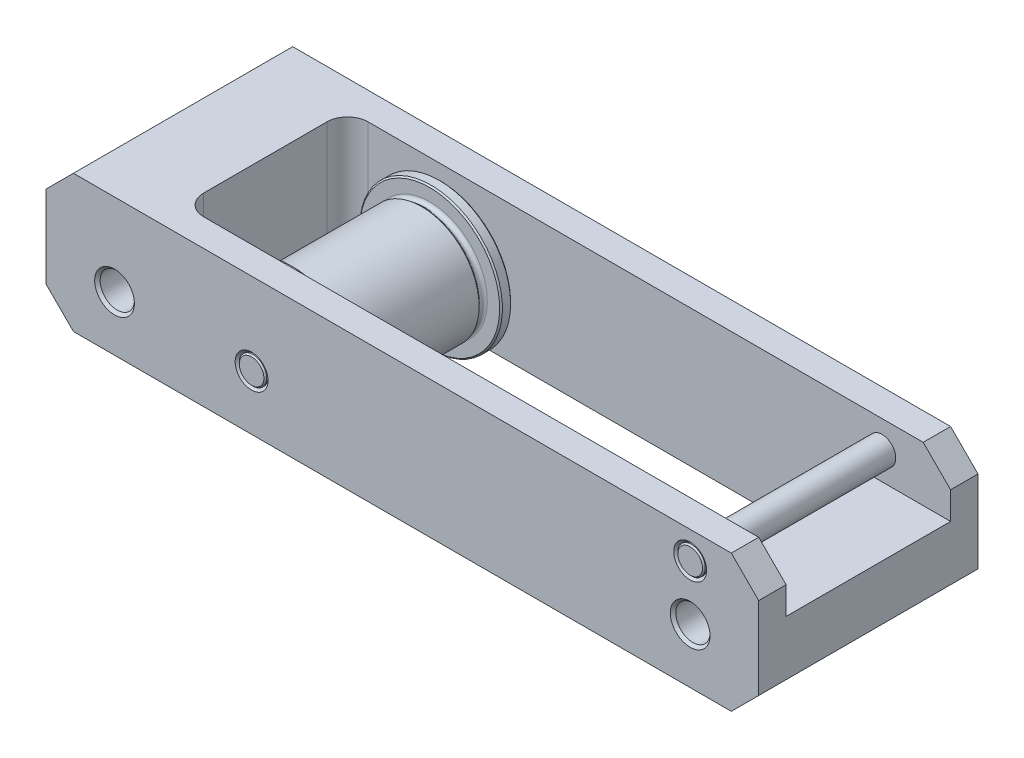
ISO-10303-21;
HEADER;
FILE_DESCRIPTION(('STEP AP214'),'2;1');
FILE_NAME('part.step','',(''),(''),'','','');
FILE_SCHEMA(('AUTOMOTIVE_DESIGN { 1 0 10303 214 1 1 1 1 }'));
ENDSEC;
DATA;
#1=APPLICATION_CONTEXT('core data for automotive mechanical design processes');
#2=APPLICATION_PROTOCOL_DEFINITION('international standard','automotive_design',2000,#1);
#3=PRODUCT_CONTEXT('',#1,'mechanical');
#4=PRODUCT('Part','Part','',(#3));
#5=PRODUCT_RELATED_PRODUCT_CATEGORY('part','',(#4));
#6=PRODUCT_DEFINITION_FORMATION('','',#4);
#7=PRODUCT_DEFINITION_CONTEXT('part definition',#1,'design');
#8=PRODUCT_DEFINITION('design','',#6,#7);
#9=PRODUCT_DEFINITION_SHAPE('','',#8);
#10=(LENGTH_UNIT() NAMED_UNIT(*) SI_UNIT(.MILLI.,.METRE.));
#11=(NAMED_UNIT(*) PLANE_ANGLE_UNIT() SI_UNIT($,.RADIAN.));
#12=(NAMED_UNIT(*) SI_UNIT($,.STERADIAN.) SOLID_ANGLE_UNIT());
#13=UNCERTAINTY_MEASURE_WITH_UNIT(LENGTH_MEASURE(1.E-05),#10,'distance_accuracy_value','');
#14=(GEOMETRIC_REPRESENTATION_CONTEXT(3) GLOBAL_UNCERTAINTY_ASSIGNED_CONTEXT((#13)) GLOBAL_UNIT_ASSIGNED_CONTEXT((#10,
#11,#12)) REPRESENTATION_CONTEXT('',''));
#15=CARTESIAN_POINT('',(0.,0.,0.));
#16=DIRECTION('',(0.,0.,1.));
#17=DIRECTION('',(1.,0.,0.));
#18=AXIS2_PLACEMENT_3D('',#15,#16,#17);
#19=CARTESIAN_POINT('',(18.0003351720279,0.624837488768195,-14.3937251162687));
#20=DIRECTION('',(0.,0.,-1.));
#21=DIRECTION('',(-1.,0.,0.));
#22=AXIS2_PLACEMENT_3D('',#19,#20,#21);
#23=CYLINDRICAL_SURFACE('',#22,4.2);
#24=CARTESIAN_POINT('',(18.0003351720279,0.624837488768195,-12.7937251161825));
#25=DIRECTION('',(0.,0.,1.));
#26=DIRECTION('',(1.,0.,0.));
#27=AXIS2_PLACEMENT_3D('',#24,#25,#26);
#28=CIRCLE('',#27,4.20000000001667);
#29=CARTESIAN_POINT('',(22.2003351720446,0.624837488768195,-12.7937251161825));
#30=VERTEX_POINT('',#29);
#31=EDGE_CURVE('E366',#30,#30,#28,.F.);
#32=ORIENTED_EDGE('',*,*,#31,.F.);
#33=EDGE_LOOP('',(#32));
#34=FACE_BOUND('',#33,.T.);
#35=CARTESIAN_POINT('',(18.0003351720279,0.624837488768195,-3.99372511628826));
#36=DIRECTION('',(0.,0.,-1.));
#37=DIRECTION('',(-1.,0.,0.));
#38=AXIS2_PLACEMENT_3D('',#35,#36,#37);
#39=CIRCLE('',#38,4.19999999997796);
#40=CARTESIAN_POINT('',(13.8003351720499,0.624837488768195,-3.99372511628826));
#41=VERTEX_POINT('',#40);
#42=EDGE_CURVE('E358',#41,#41,#39,.F.);
#43=ORIENTED_EDGE('',*,*,#42,.F.);
#44=EDGE_LOOP('',(#43));
#45=FACE_BOUND('',#44,.T.);
#46=ADVANCED_FACE('F17',(#34,#45),#23,.T.);
#47=CARTESIAN_POINT('',(18.0003351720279,0.624837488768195,-12.7937251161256));
#48=DIRECTION('',(0.,0.,1.));
#49=DIRECTION('',(1.,0.,0.));
#50=AXIS2_PLACEMENT_3D('',#47,#48,#49);
#51=CONICAL_SURFACE('',#50,4.20000000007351,0.785398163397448);
#52=ORIENTED_EDGE('',*,*,#31,.T.);
#53=EDGE_LOOP('',(#52));
#54=FACE_BOUND('',#53,.T.);
#55=CARTESIAN_POINT('',(18.0003351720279,0.624837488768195,-12.9437251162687));
#56=DIRECTION('',(0.,0.,-1.));
#57=DIRECTION('',(-1.,0.,0.));
#58=AXIS2_PLACEMENT_3D('',#55,#56,#57);
#59=CIRCLE('',#58,4.05);
#60=CARTESIAN_POINT('',(13.9503351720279,0.624837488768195,-12.9437251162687));
#61=VERTEX_POINT('',#60);
#62=EDGE_CURVE('E353',#61,#61,#59,.F.);
#63=ORIENTED_EDGE('',*,*,#62,.T.);
#64=EDGE_LOOP('',(#63));
#65=FACE_BOUND('',#64,.T.);
#66=ADVANCED_FACE('F1266',(#54,#65),#51,.T.);
#67=CARTESIAN_POINT('',(18.0003351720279,0.624837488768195,-3.99372511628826));
#68=DIRECTION('',(0.,0.,-1.));
#69=DIRECTION('',(-1.,0.,0.));
#70=AXIS2_PLACEMENT_3D('',#67,#68,#69);
#71=CONICAL_SURFACE('',#70,4.19999999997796,0.78539816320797);
#72=ORIENTED_EDGE('',*,*,#42,.T.);
#73=EDGE_LOOP('',(#72));
#74=FACE_BOUND('',#73,.T.);
#75=CARTESIAN_POINT('',(18.0003351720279,0.624837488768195,-3.84372511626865));
#76=DIRECTION('',(0.,0.,-1.));
#77=DIRECTION('',(-1.,0.,0.));
#78=AXIS2_PLACEMENT_3D('',#75,#76,#77);
#79=CIRCLE('',#78,4.05);
#80=CARTESIAN_POINT('',(13.9503351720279,0.624837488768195,-3.84372511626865));
#81=VERTEX_POINT('',#80);
#82=EDGE_CURVE('E351',#81,#81,#79,.T.);
#83=ORIENTED_EDGE('',*,*,#82,.T.);
#84=EDGE_LOOP('',(#83));
#85=FACE_BOUND('',#84,.T.);
#86=ADVANCED_FACE('F1258',(#74,#85),#71,.T.);
#87=CARTESIAN_POINT('',(18.0003351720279,0.624837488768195,-13.1437251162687));
#88=DIRECTION('',(0.,0.,-1.));
#89=DIRECTION('',(-1.,0.,0.));
#90=AXIS2_PLACEMENT_3D('',#87,#88,#89);
#91=TOROIDAL_SURFACE('',#90,4.2,0.25);
#92=ORIENTED_EDGE('',*,*,#62,.F.);
#93=EDGE_LOOP('',(#92));
#94=FACE_BOUND('',#93,.T.);
#95=CARTESIAN_POINT('',(18.0003351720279,0.624837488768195,-13.3937251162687));
#96=DIRECTION('',(0.,0.,1.));
#97=DIRECTION('',(-1.,0.,0.));
#98=AXIS2_PLACEMENT_3D('',#95,#96,#97);
#99=CIRCLE('',#98,4.2);
#100=CARTESIAN_POINT('',(13.8003351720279,0.624837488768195,-13.3937251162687));
#101=VERTEX_POINT('',#100);
#102=CARTESIAN_POINT('',(22.2003351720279,0.624837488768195,-13.3937251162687));
#103=VERTEX_POINT('',#102);
#104=EDGE_CURVE('E306',#101,#103,#99,.T.);
#105=ORIENTED_EDGE('',*,*,#104,.T.);
#106=CARTESIAN_POINT('',(18.0003351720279,0.624837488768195,-13.3937251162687));
#107=DIRECTION('',(0.,0.,1.));
#108=DIRECTION('',(1.,0.,0.));
#109=AXIS2_PLACEMENT_3D('',#106,#107,#108);
#110=CIRCLE('',#109,4.2);
#111=EDGE_CURVE('E316',#103,#101,#110,.T.);
#112=ORIENTED_EDGE('',*,*,#111,.T.);
#113=EDGE_LOOP('',(#105,#112));
#114=FACE_BOUND('',#113,.T.);
#115=ADVANCED_FACE('F331',(#94,#114),#91,.F.);
#116=CARTESIAN_POINT('',(18.0003351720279,0.624837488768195,-3.64372511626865));
#117=DIRECTION('',(0.,0.,-1.));
#118=DIRECTION('',(-1.,0.,0.));
#119=AXIS2_PLACEMENT_3D('',#116,#117,#118);
#120=TOROIDAL_SURFACE('',#119,4.2,0.25);
#121=ORIENTED_EDGE('',*,*,#82,.F.);
#122=EDGE_LOOP('',(#121));
#123=FACE_BOUND('',#122,.T.);
#124=CARTESIAN_POINT('',(18.0003351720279,0.624837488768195,-3.39372511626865));
#125=DIRECTION('',(0.,0.,-1.));
#126=DIRECTION('',(-1.,0.,0.));
#127=AXIS2_PLACEMENT_3D('',#124,#125,#126);
#128=CIRCLE('',#127,4.2);
#129=CARTESIAN_POINT('',(13.8003351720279,0.624837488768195,-3.39372511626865));
#130=VERTEX_POINT('',#129);
#131=CARTESIAN_POINT('',(22.2003351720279,0.624837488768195,-3.39372511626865));
#132=VERTEX_POINT('',#131);
#133=EDGE_CURVE('E458',#130,#132,#128,.T.);
#134=ORIENTED_EDGE('',*,*,#133,.T.);
#135=CARTESIAN_POINT('',(18.0003351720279,0.624837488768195,-3.39372511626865));
#136=DIRECTION('',(0.,0.,-1.));
#137=DIRECTION('',(1.,0.,0.));
#138=AXIS2_PLACEMENT_3D('',#135,#136,#137);
#139=CIRCLE('',#138,4.2);
#140=EDGE_CURVE('E272',#132,#130,#139,.T.);
#141=ORIENTED_EDGE('',*,*,#140,.T.);
#142=EDGE_LOOP('',(#134,#141));
#143=FACE_BOUND('',#142,.T.);
#144=ADVANCED_FACE('F328',(#123,#143),#120,.F.);
#145=CARTESIAN_POINT('',(18.0003351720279,5.82483748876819,-13.3937251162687));
#146=DIRECTION('',(0.,0.,-1.));
#147=DIRECTION('',(-1.,0.,0.));
#148=AXIS2_PLACEMENT_3D('',#145,#146,#147);
#149=PLANE('',#148);
#150=ORIENTED_EDGE('',*,*,#104,.F.);
#151=ORIENTED_EDGE('',*,*,#111,.F.);
#152=EDGE_LOOP('',(#150,#151));
#153=FACE_BOUND('',#152,.T.);
#154=CARTESIAN_POINT('',(18.0003351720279,0.624837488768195,-13.3937251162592));
#155=DIRECTION('',(0.,0.,-1.));
#156=DIRECTION('',(-1.,0.,0.));
#157=AXIS2_PLACEMENT_3D('',#154,#155,#156);
#158=CIRCLE('',#157,5.09999999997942);
#159=CARTESIAN_POINT('',(12.9003351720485,0.624837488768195,-13.3937251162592));
#160=VERTEX_POINT('',#159);
#161=EDGE_CURVE('E455',#160,#160,#158,.T.);
#162=ORIENTED_EDGE('',*,*,#161,.F.);
#163=EDGE_LOOP('',(#162));
#164=FACE_BOUND('',#163,.T.);
#165=ADVANCED_FACE('F289',(#153,#164),#149,.F.);
#166=CARTESIAN_POINT('',(18.0003351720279,4.82483748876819,-3.39372511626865));
#167=DIRECTION('',(0.,0.,1.));
#168=DIRECTION('',(1.,0.,0.));
#169=AXIS2_PLACEMENT_3D('',#166,#167,#168);
#170=PLANE('',#169);
#171=ORIENTED_EDGE('',*,*,#140,.F.);
#172=ORIENTED_EDGE('',*,*,#133,.F.);
#173=EDGE_LOOP('',(#171,#172));
#174=FACE_BOUND('',#173,.T.);
#175=CARTESIAN_POINT('',(18.0003351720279,0.624837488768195,-3.39372511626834));
#176=DIRECTION('',(0.,0.,1.));
#177=DIRECTION('',(1.,0.,0.));
#178=AXIS2_PLACEMENT_3D('',#175,#176,#177);
#179=CIRCLE('',#178,5.10000000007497);
#180=CARTESIAN_POINT('',(23.1003351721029,0.624837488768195,-3.39372511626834));
#181=VERTEX_POINT('',#180);
#182=EDGE_CURVE('E267',#181,#181,#179,.T.);
#183=ORIENTED_EDGE('',*,*,#182,.F.);
#184=EDGE_LOOP('',(#183));
#185=FACE_BOUND('',#184,.T.);
#186=ADVANCED_FACE('F278',(#174,#185),#170,.F.);
#187=CARTESIAN_POINT('',(18.0003351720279,0.624837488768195,-13.4937251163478));
#188=DIRECTION('',(0.,0.,-1.));
#189=DIRECTION('',(-1.,0.,0.));
#190=AXIS2_PLACEMENT_3D('',#187,#188,#189);
#191=CONICAL_SURFACE('',#190,5.200000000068,0.785398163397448);
#192=ORIENTED_EDGE('',*,*,#161,.T.);
#193=EDGE_LOOP('',(#192));
#194=FACE_BOUND('',#193,.T.);
#195=CARTESIAN_POINT('',(18.0003351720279,0.624837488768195,-13.4937251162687));
#196=DIRECTION('',(0.,0.,-1.));
#197=DIRECTION('',(-1.,0.,0.));
#198=AXIS2_PLACEMENT_3D('',#195,#196,#197);
#199=CIRCLE('',#198,5.2);
#200=CARTESIAN_POINT('',(12.8003351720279,0.624837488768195,-13.4937251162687));
#201=VERTEX_POINT('',#200);
#202=EDGE_CURVE('E264',#201,#201,#199,.T.);
#203=ORIENTED_EDGE('',*,*,#202,.F.);
#204=EDGE_LOOP('',(#203));
#205=FACE_BOUND('',#204,.T.);
#206=ADVANCED_FACE('F288',(#194,#205),#191,.T.);
#207=CARTESIAN_POINT('',(18.0003351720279,0.624837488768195,-3.29372511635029));
#208=DIRECTION('',(0.,0.,1.));
#209=DIRECTION('',(1.,0.,0.));
#210=AXIS2_PLACEMENT_3D('',#207,#208,#209);
#211=CONICAL_SURFACE('',#210,5.19999999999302,0.785398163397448);
#212=ORIENTED_EDGE('',*,*,#182,.T.);
#213=EDGE_LOOP('',(#212));
#214=FACE_BOUND('',#213,.T.);
#215=CARTESIAN_POINT('',(18.0003351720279,0.624837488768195,-3.29372511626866));
#216=DIRECTION('',(0.,0.,-1.));
#217=DIRECTION('',(-1.,0.,0.));
#218=AXIS2_PLACEMENT_3D('',#215,#216,#217);
#219=CIRCLE('',#218,5.2);
#220=CARTESIAN_POINT('',(12.8003351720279,0.624837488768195,-3.29372511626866));
#221=VERTEX_POINT('',#220);
#222=EDGE_CURVE('E253',#221,#221,#219,.F.);
#223=ORIENTED_EDGE('',*,*,#222,.F.);
#224=EDGE_LOOP('',(#223));
#225=FACE_BOUND('',#224,.T.);
#226=ADVANCED_FACE('F1219',(#214,#225),#211,.T.);
#227=CARTESIAN_POINT('',(18.0003351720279,0.624837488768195,-14.3937251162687));
#228=DIRECTION('',(0.,0.,-1.));
#229=DIRECTION('',(-1.,0.,0.));
#230=AXIS2_PLACEMENT_3D('',#227,#228,#229);
#231=CYLINDRICAL_SURFACE('',#230,5.2);
#232=ORIENTED_EDGE('',*,*,#202,.T.);
#233=EDGE_LOOP('',(#232));
#234=FACE_BOUND('',#233,.T.);
#235=CARTESIAN_POINT('',(18.0003351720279,0.624837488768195,-14.0937251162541));
#236=DIRECTION('',(0.,0.,1.));
#237=DIRECTION('',(1.,0.,0.));
#238=AXIS2_PLACEMENT_3D('',#235,#236,#237);
#239=CIRCLE('',#238,5.20000000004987);
#240=CARTESIAN_POINT('',(23.2003351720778,0.624837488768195,-14.0937251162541));
#241=VERTEX_POINT('',#240);
#242=EDGE_CURVE('E250',#241,#241,#239,.F.);
#243=ORIENTED_EDGE('',*,*,#242,.F.);
#244=EDGE_LOOP('',(#243));
#245=FACE_BOUND('',#244,.T.);
#246=ADVANCED_FACE('F1210',(#234,#245),#231,.T.);
#247=CARTESIAN_POINT('',(18.0003351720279,0.624837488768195,-14.3937251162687));
#248=DIRECTION('',(0.,0.,-1.));
#249=DIRECTION('',(-1.,0.,0.));
#250=AXIS2_PLACEMENT_3D('',#247,#248,#249);
#251=CYLINDRICAL_SURFACE('',#250,5.2);
#252=CARTESIAN_POINT('',(18.0003351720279,0.624837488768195,-2.69372511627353));
#253=DIRECTION('',(0.,0.,-1.));
#254=DIRECTION('',(-1.,0.,0.));
#255=AXIS2_PLACEMENT_3D('',#252,#253,#254);
#256=CIRCLE('',#255,5.20000000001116);
#257=CARTESIAN_POINT('',(12.8003351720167,0.624837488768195,-2.69372511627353));
#258=VERTEX_POINT('',#257);
#259=EDGE_CURVE('E246',#258,#258,#256,.F.);
#260=ORIENTED_EDGE('',*,*,#259,.F.);
#261=EDGE_LOOP('',(#260));
#262=FACE_BOUND('',#261,.T.);
#263=ORIENTED_EDGE('',*,*,#222,.T.);
#264=EDGE_LOOP('',(#263));
#265=FACE_BOUND('',#264,.T.);
#266=ADVANCED_FACE('F1201',(#262,#265),#251,.T.);
#267=CARTESIAN_POINT('',(18.0003351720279,0.624837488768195,-14.0937251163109));
#268=DIRECTION('',(0.,0.,1.));
#269=DIRECTION('',(0.,-1.,0.));
#270=AXIS2_PLACEMENT_3D('',#267,#268,#269);
#271=CONICAL_SURFACE('',#270,5.19999999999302,0.785398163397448);
#272=CARTESIAN_POINT('',(18.0003351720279,0.624837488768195,-14.1937251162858));
#273=DIRECTION('',(0.,0.,1.));
#274=DIRECTION('',(0.,-1.,0.));
#275=AXIS2_PLACEMENT_3D('',#272,#273,#274);
#276=CIRCLE('',#275,5.10000000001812);
#277=CARTESIAN_POINT('',(18.0003351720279,-4.47516251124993,-14.1937251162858));
#278=VERTEX_POINT('',#277);
#279=EDGE_CURVE('E249',#278,#278,#276,.T.);
#280=ORIENTED_EDGE('',*,*,#279,.T.);
#281=EDGE_LOOP('',(#280));
#282=FACE_BOUND('',#281,.T.);
#283=ORIENTED_EDGE('',*,*,#242,.T.);
#284=EDGE_LOOP('',(#283));
#285=FACE_BOUND('',#284,.T.);
#286=ADVANCED_FACE('F1192',(#282,#285),#271,.T.);
#287=CARTESIAN_POINT('',(18.0003351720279,0.624837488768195,-2.69372511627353));
#288=DIRECTION('',(0.,0.,-1.));
#289=DIRECTION('',(-1.,0.,0.));
#290=AXIS2_PLACEMENT_3D('',#287,#288,#289);
#291=CONICAL_SURFACE('',#290,5.20000000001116,0.785398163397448);
#292=CARTESIAN_POINT('',(18.0003351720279,0.624837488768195,-2.59372511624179));
#293=DIRECTION('',(0.,0.,-1.));
#294=DIRECTION('',(-1.,0.,0.));
#295=AXIS2_PLACEMENT_3D('',#292,#293,#294);
#296=CIRCLE('',#295,5.09999999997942);
#297=CARTESIAN_POINT('',(12.9003351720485,0.624837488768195,-2.59372511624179));
#298=VERTEX_POINT('',#297);
#299=EDGE_CURVE('E448',#298,#298,#296,.T.);
#300=ORIENTED_EDGE('',*,*,#299,.T.);
#301=EDGE_LOOP('',(#300));
#302=FACE_BOUND('',#301,.T.);
#303=ORIENTED_EDGE('',*,*,#259,.T.);
#304=EDGE_LOOP('',(#303));
#305=FACE_BOUND('',#304,.T.);
#306=ADVANCED_FACE('F1183',(#302,#305),#291,.T.);
#307=CARTESIAN_POINT('',(50.0003351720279,4.6248374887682,-0.393725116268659));
#308=DIRECTION('',(0.,0.,1.));
#309=DIRECTION('',(1.,0.,0.));
#310=AXIS2_PLACEMENT_3D('',#307,#308,#309);
#311=PLANE('',#310);
#312=CARTESIAN_POINT('',(50.0003351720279,4.6248374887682,-0.39372511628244));
#313=DIRECTION('',(0.,0.,-1.));
#314=DIRECTION('',(-1.,0.,0.));
#315=AXIS2_PLACEMENT_3D('',#312,#313,#314);
#316=CIRCLE('',#315,0.900000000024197);
#317=CARTESIAN_POINT('',(49.1003351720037,4.6248374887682,-0.39372511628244));
#318=VERTEX_POINT('',#317);
#319=EDGE_CURVE('E445',#318,#318,#316,.T.);
#320=ORIENTED_EDGE('',*,*,#319,.F.);
#321=EDGE_LOOP('',(#320));
#322=FACE_BOUND('',#321,.T.);
#323=ADVANCED_FACE('F1174',(#322),#311,.T.);
#324=CARTESIAN_POINT('',(18.0003351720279,0.624837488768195,-0.393725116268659));
#325=DIRECTION('',(0.,0.,1.));
#326=DIRECTION('',(1.,0.,0.));
#327=AXIS2_PLACEMENT_3D('',#324,#325,#326);
#328=PLANE('',#327);
#329=CARTESIAN_POINT('',(18.0003351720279,0.624837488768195,-0.39372511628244));
#330=DIRECTION('',(0.,0.,-1.));
#331=DIRECTION('',(-1.,0.,0.));
#332=AXIS2_PLACEMENT_3D('',#329,#330,#331);
#333=CIRCLE('',#332,0.900000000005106);
#334=CARTESIAN_POINT('',(17.1003351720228,0.624837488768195,-0.39372511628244));
#335=VERTEX_POINT('',#334);
#336=EDGE_CURVE('E442',#335,#335,#333,.T.);
#337=ORIENTED_EDGE('',*,*,#336,.F.);
#338=EDGE_LOOP('',(#337));
#339=FACE_BOUND('',#338,.T.);
#340=ADVANCED_FACE('F1165',(#339),#328,.T.);
#341=CARTESIAN_POINT('',(18.0003351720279,5.82483748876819,-14.1937251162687));
#342=DIRECTION('',(0.,0.,1.));
#343=DIRECTION('',(1.,0.,0.));
#344=AXIS2_PLACEMENT_3D('',#341,#342,#343);
#345=PLANE('',#344);
#346=CARTESIAN_POINT('',(18.0003351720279,0.624837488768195,-14.1937251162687));
#347=DIRECTION('',(0.,0.,-1.));
#348=DIRECTION('',(-1.,0.,0.));
#349=AXIS2_PLACEMENT_3D('',#346,#347,#348);
#350=CIRCLE('',#349,2.5);
#351=CARTESIAN_POINT('',(15.5003351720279,0.624837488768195,-14.1937251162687));
#352=VERTEX_POINT('',#351);
#353=EDGE_CURVE('E439',#352,#352,#350,.T.);
#354=ORIENTED_EDGE('',*,*,#353,.F.);
#355=EDGE_LOOP('',(#354));
#356=FACE_BOUND('',#355,.T.);
#357=ORIENTED_EDGE('',*,*,#279,.F.);
#358=EDGE_LOOP('',(#357));
#359=FACE_BOUND('',#358,.T.);
#360=ADVANCED_FACE('F1156',(#356,#359),#345,.F.);
#361=CARTESIAN_POINT('',(18.0003351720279,5.82483748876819,-2.59372511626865));
#362=DIRECTION('',(0.,0.,-1.));
#363=DIRECTION('',(-1.,0.,0.));
#364=AXIS2_PLACEMENT_3D('',#361,#362,#363);
#365=PLANE('',#364);
#366=CARTESIAN_POINT('',(18.0003351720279,0.624837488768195,-2.59372511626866));
#367=DIRECTION('',(0.,0.,-1.));
#368=DIRECTION('',(-1.,0.,0.));
#369=AXIS2_PLACEMENT_3D('',#366,#367,#368);
#370=CIRCLE('',#369,2.5);
#371=CARTESIAN_POINT('',(15.5003351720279,0.624837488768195,-2.59372511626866));
#372=VERTEX_POINT('',#371);
#373=EDGE_CURVE('E261',#372,#372,#370,.F.);
#374=ORIENTED_EDGE('',*,*,#373,.F.);
#375=EDGE_LOOP('',(#374));
#376=FACE_BOUND('',#375,.T.);
#377=ORIENTED_EDGE('',*,*,#299,.F.);
#378=EDGE_LOOP('',(#377));
#379=FACE_BOUND('',#378,.T.);
#380=ADVANCED_FACE('F1147',(#376,#379),#365,.F.);
#381=CARTESIAN_POINT('',(50.0003351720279,4.6248374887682,-0.493725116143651));
#382=DIRECTION('',(0.,0.,-1.));
#383=DIRECTION('',(-1.,0.,0.));
#384=AXIS2_PLACEMENT_3D('',#381,#382,#383);
#385=CONICAL_SURFACE('',#384,0.999999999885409,0.785398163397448);
#386=CARTESIAN_POINT('',(50.0003351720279,4.6248374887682,-0.493725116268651));
#387=DIRECTION('',(0.,0.,-1.));
#388=DIRECTION('',(-1.,0.,0.));
#389=AXIS2_PLACEMENT_3D('',#386,#387,#388);
#390=CIRCLE('',#389,1.);
#391=CARTESIAN_POINT('',(49.0003351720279,4.6248374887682,-0.493725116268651));
#392=VERTEX_POINT('',#391);
#393=EDGE_CURVE('E258',#392,#392,#390,.T.);
#394=ORIENTED_EDGE('',*,*,#393,.F.);
#395=EDGE_LOOP('',(#394));
#396=FACE_BOUND('',#395,.T.);
#397=ORIENTED_EDGE('',*,*,#319,.T.);
#398=EDGE_LOOP('',(#397));
#399=FACE_BOUND('',#398,.T.);
#400=ADVANCED_FACE('F1138',(#396,#399),#385,.T.);
#401=CARTESIAN_POINT('',(18.0003351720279,0.624837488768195,-0.493725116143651));
#402=DIRECTION('',(0.,0.,-1.));
#403=DIRECTION('',(-1.,0.,0.));
#404=AXIS2_PLACEMENT_3D('',#401,#402,#403);
#405=CONICAL_SURFACE('',#404,0.999999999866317,0.785398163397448);
#406=CARTESIAN_POINT('',(18.0003351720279,0.624837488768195,-0.493725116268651));
#407=DIRECTION('',(0.,0.,-1.));
#408=DIRECTION('',(-1.,0.,0.));
#409=AXIS2_PLACEMENT_3D('',#406,#407,#408);
#410=CIRCLE('',#409,1.);
#411=CARTESIAN_POINT('',(17.0003351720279,0.624837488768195,-0.493725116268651));
#412=VERTEX_POINT('',#411);
#413=EDGE_CURVE('E254',#412,#412,#410,.T.);
#414=ORIENTED_EDGE('',*,*,#413,.F.);
#415=EDGE_LOOP('',(#414));
#416=FACE_BOUND('',#415,.T.);
#417=ORIENTED_EDGE('',*,*,#336,.T.);
#418=EDGE_LOOP('',(#417));
#419=FACE_BOUND('',#418,.T.);
#420=ADVANCED_FACE('F1129',(#416,#419),#405,.T.);
#421=CARTESIAN_POINT('',(50.0003351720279,4.6248374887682,-16.3937251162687));
#422=DIRECTION('',(0.,0.,1.));
#423=DIRECTION('',(1.,0.,0.));
#424=AXIS2_PLACEMENT_3D('',#421,#422,#423);
#425=PLANE('',#424);
#426=CARTESIAN_POINT('',(50.0003351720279,4.6248374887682,-16.3937251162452));
#427=DIRECTION('',(0.,0.,1.));
#428=DIRECTION('',(1.,0.,0.));
#429=AXIS2_PLACEMENT_3D('',#426,#427,#428);
#430=CIRCLE('',#429,0.900000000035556);
#431=CARTESIAN_POINT('',(50.9003351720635,4.6248374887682,-16.3937251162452));
#432=VERTEX_POINT('',#431);
#433=EDGE_CURVE('E257',#432,#432,#430,.T.);
#434=ORIENTED_EDGE('',*,*,#433,.F.);
#435=EDGE_LOOP('',(#434));
#436=FACE_BOUND('',#435,.T.);
#437=ADVANCED_FACE('F1120',(#436),#425,.F.);
#438=CARTESIAN_POINT('',(18.0003351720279,0.624837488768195,-16.3937251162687));
#439=DIRECTION('',(0.,0.,1.));
#440=DIRECTION('',(1.,0.,0.));
#441=AXIS2_PLACEMENT_3D('',#438,#439,#440);
#442=PLANE('',#441);
#443=CARTESIAN_POINT('',(18.0003351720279,0.624837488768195,-16.3937251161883));
#444=DIRECTION('',(0.,0.,1.));
#445=DIRECTION('',(1.,0.,0.));
#446=AXIS2_PLACEMENT_3D('',#443,#444,#445);
#447=CIRCLE('',#446,0.899999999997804);
#448=CARTESIAN_POINT('',(18.9003351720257,0.624837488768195,-16.3937251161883));
#449=VERTEX_POINT('',#448);
#450=EDGE_CURVE('E239',#449,#449,#447,.T.);
#451=ORIENTED_EDGE('',*,*,#450,.F.);
#452=EDGE_LOOP('',(#451));
#453=FACE_BOUND('',#452,.T.);
#454=ADVANCED_FACE('F1111',(#453),#442,.F.);
#455=CARTESIAN_POINT('',(18.0003351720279,0.624837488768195,-14.3937251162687));
#456=DIRECTION('',(0.,0.,-1.));
#457=DIRECTION('',(-1.,0.,0.));
#458=AXIS2_PLACEMENT_3D('',#455,#456,#457);
#459=CYLINDRICAL_SURFACE('',#458,2.5);
#460=ORIENTED_EDGE('',*,*,#353,.T.);
#461=EDGE_LOOP('',(#460));
#462=FACE_BOUND('',#461,.T.);
#463=CARTESIAN_POINT('',(18.0003351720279,0.624837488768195,-14.2937251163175));
#464=DIRECTION('',(0.,0.,1.));
#465=DIRECTION('',(1.,0.,0.));
#466=AXIS2_PLACEMENT_3D('',#463,#464,#465);
#467=CIRCLE('',#466,2.5000000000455);
#468=CARTESIAN_POINT('',(20.5003351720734,0.624837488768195,-14.2937251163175));
#469=VERTEX_POINT('',#468);
#470=EDGE_CURVE('E236',#469,#469,#467,.F.);
#471=ORIENTED_EDGE('',*,*,#470,.F.);
#472=EDGE_LOOP('',(#471));
#473=FACE_BOUND('',#472,.T.);
#474=ADVANCED_FACE('F1102',(#462,#473),#459,.T.);
#475=CARTESIAN_POINT('',(18.0003351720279,0.624837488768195,-14.3937251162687));
#476=DIRECTION('',(0.,0.,-1.));
#477=DIRECTION('',(-1.,0.,0.));
#478=AXIS2_PLACEMENT_3D('',#475,#476,#477);
#479=CYLINDRICAL_SURFACE('',#478,2.5);
#480=CARTESIAN_POINT('',(18.0003351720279,0.624837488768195,-2.49372511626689));
#481=DIRECTION('',(0.,0.,-1.));
#482=DIRECTION('',(-1.,0.,0.));
#483=AXIS2_PLACEMENT_3D('',#480,#481,#482);
#484=CIRCLE('',#483,2.49999999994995);
#485=CARTESIAN_POINT('',(15.5003351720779,0.624837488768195,-2.49372511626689));
#486=VERTEX_POINT('',#485);
#487=EDGE_CURVE('E233',#486,#486,#484,.F.);
#488=ORIENTED_EDGE('',*,*,#487,.F.);
#489=EDGE_LOOP('',(#488));
#490=FACE_BOUND('',#489,.T.);
#491=ORIENTED_EDGE('',*,*,#373,.T.);
#492=EDGE_LOOP('',(#491));
#493=FACE_BOUND('',#492,.T.);
#494=ADVANCED_FACE('F1093',(#490,#493),#479,.T.);
#495=CARTESIAN_POINT('',(50.0003351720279,4.6248374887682,-0.393725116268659));
#496=DIRECTION('',(0.,0.,-1.));
#497=DIRECTION('',(-1.,0.,0.));
#498=AXIS2_PLACEMENT_3D('',#495,#496,#497);
#499=CYLINDRICAL_SURFACE('',#498,1.);
#500=CARTESIAN_POINT('',(50.0003351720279,4.6248374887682,-0.593725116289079));
#501=DIRECTION('',(0.,0.,1.));
#502=DIRECTION('',(1.,0.,0.));
#503=AXIS2_PLACEMENT_3D('',#500,#501,#502);
#504=CIRCLE('',#503,1.00000000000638);
#505=CARTESIAN_POINT('',(51.0003351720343,4.6248374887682,-0.593725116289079));
#506=VERTEX_POINT('',#505);
#507=EDGE_CURVE('E227',#506,#506,#504,.T.);
#508=ORIENTED_EDGE('',*,*,#507,.T.);
#509=EDGE_LOOP('',(#508));
#510=FACE_BOUND('',#509,.T.);
#511=ORIENTED_EDGE('',*,*,#393,.T.);
#512=EDGE_LOOP('',(#511));
#513=FACE_BOUND('',#512,.T.);
#514=ADVANCED_FACE('F1084',(#510,#513),#499,.T.);
#515=CARTESIAN_POINT('',(18.0003351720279,0.624837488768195,-0.393725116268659));
#516=DIRECTION('',(0.,0.,-1.));
#517=DIRECTION('',(-1.,0.,0.));
#518=AXIS2_PLACEMENT_3D('',#515,#516,#517);
#519=CYLINDRICAL_SURFACE('',#518,1.);
#520=CARTESIAN_POINT('',(18.0003351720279,0.624837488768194,-0.593725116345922));
#521=DIRECTION('',(0.,0.,1.));
#522=DIRECTION('',(1.,0.,0.));
#523=AXIS2_PLACEMENT_3D('',#520,#521,#522);
#524=CIRCLE('',#523,1.00000000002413);
#525=CARTESIAN_POINT('',(19.000335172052,0.624837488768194,-0.593725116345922));
#526=VERTEX_POINT('',#525);
#527=EDGE_CURVE('E224',#526,#526,#524,.T.);
#528=ORIENTED_EDGE('',*,*,#527,.T.);
#529=EDGE_LOOP('',(#528));
#530=FACE_BOUND('',#529,.T.);
#531=ORIENTED_EDGE('',*,*,#413,.T.);
#532=EDGE_LOOP('',(#531));
#533=FACE_BOUND('',#532,.T.);
#534=ADVANCED_FACE('F1075',(#530,#533),#519,.T.);
#535=CARTESIAN_POINT('',(50.0003351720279,4.6248374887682,-16.2937251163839));
#536=DIRECTION('',(0.,0.,1.));
#537=DIRECTION('',(1.,0.,0.));
#538=AXIS2_PLACEMENT_3D('',#535,#536,#537);
#539=CONICAL_SURFACE('',#538,0.999999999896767,0.785398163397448);
#540=ORIENTED_EDGE('',*,*,#433,.T.);
#541=EDGE_LOOP('',(#540));
#542=FACE_BOUND('',#541,.T.);
#543=CARTESIAN_POINT('',(50.0003351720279,4.6248374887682,-16.2937251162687));
#544=DIRECTION('',(0.,0.,-1.));
#545=DIRECTION('',(-1.,0.,0.));
#546=AXIS2_PLACEMENT_3D('',#543,#544,#545);
#547=CIRCLE('',#546,1.);
#548=CARTESIAN_POINT('',(49.0003351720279,4.6248374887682,-16.2937251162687));
#549=VERTEX_POINT('',#548);
#550=EDGE_CURVE('E220',#549,#549,#547,.F.);
#551=ORIENTED_EDGE('',*,*,#550,.F.);
#552=EDGE_LOOP('',(#551));
#553=FACE_BOUND('',#552,.T.);
#554=ADVANCED_FACE('F1066',(#542,#553),#539,.T.);
#555=CARTESIAN_POINT('',(18.0003351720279,0.624837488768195,-16.2937251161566));
#556=DIRECTION('',(0.,0.,1.));
#557=DIRECTION('',(1.,0.,0.));
#558=AXIS2_PLACEMENT_3D('',#555,#556,#557);
#559=CONICAL_SURFACE('',#558,0.999999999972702,0.785398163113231);
#560=ORIENTED_EDGE('',*,*,#450,.T.);
#561=EDGE_LOOP('',(#560));
#562=FACE_BOUND('',#561,.T.);
#563=CARTESIAN_POINT('',(18.0003351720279,0.624837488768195,-16.2937251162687));
#564=DIRECTION('',(0.,0.,-1.));
#565=DIRECTION('',(-1.,0.,0.));
#566=AXIS2_PLACEMENT_3D('',#563,#564,#565);
#567=CIRCLE('',#566,1.);
#568=CARTESIAN_POINT('',(17.0003351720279,0.624837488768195,-16.2937251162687));
#569=VERTEX_POINT('',#568);
#570=EDGE_CURVE('E240',#569,#569,#567,.F.);
#571=ORIENTED_EDGE('',*,*,#570,.F.);
#572=EDGE_LOOP('',(#571));
#573=FACE_BOUND('',#572,.T.);
#574=ADVANCED_FACE('F1057',(#562,#573),#559,.T.);
#575=CARTESIAN_POINT('',(18.0003351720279,0.624837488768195,-14.2937251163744));
#576=DIRECTION('',(0.,0.,1.));
#577=DIRECTION('',(1.,0.,0.));
#578=AXIS2_PLACEMENT_3D('',#575,#576,#577);
#579=CONICAL_SURFACE('',#578,2.49999999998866,0.785398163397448);
#580=CARTESIAN_POINT('',(18.0003351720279,0.624837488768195,-14.3937251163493));
#581=DIRECTION('',(0.,0.,1.));
#582=DIRECTION('',(1.,0.,0.));
#583=AXIS2_PLACEMENT_3D('',#580,#581,#582);
#584=CIRCLE('',#583,2.40000000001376);
#585=CARTESIAN_POINT('',(20.4003351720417,0.624837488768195,-14.3937251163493));
#586=VERTEX_POINT('',#585);
#587=EDGE_CURVE('E430',#586,#586,#584,.T.);
#588=ORIENTED_EDGE('',*,*,#587,.T.);
#589=EDGE_LOOP('',(#588));
#590=FACE_BOUND('',#589,.T.);
#591=ORIENTED_EDGE('',*,*,#470,.T.);
#592=EDGE_LOOP('',(#591));
#593=FACE_BOUND('',#592,.T.);
#594=ADVANCED_FACE('F1048',(#590,#593),#579,.T.);
#595=CARTESIAN_POINT('',(50.0003351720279,4.6248374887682,-0.393725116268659));
#596=DIRECTION('',(0.,0.,-1.));
#597=DIRECTION('',(-1.,0.,0.));
#598=AXIS2_PLACEMENT_3D('',#595,#596,#597);
#599=CYLINDRICAL_SURFACE('',#598,1.);
#600=CARTESIAN_POINT('',(50.0003351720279,4.6248374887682,-14.3937251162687));
#601=DIRECTION('',(0.,0.,-1.));
#602=DIRECTION('',(-1.,0.,0.));
#603=AXIS2_PLACEMENT_3D('',#600,#601,#602);
#604=CIRCLE('',#603,1.);
#605=CARTESIAN_POINT('',(49.0003351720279,4.6248374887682,-14.3937251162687));
#606=VERTEX_POINT('',#605);
#607=EDGE_CURVE('E204',#606,#606,#604,.F.);
#608=ORIENTED_EDGE('',*,*,#607,.T.);
#609=EDGE_LOOP('',(#608));
#610=FACE_BOUND('',#609,.T.);
#611=CARTESIAN_POINT('',(50.0003351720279,4.6248374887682,-2.19372511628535));
#612=DIRECTION('',(0.,0.,-1.));
#613=DIRECTION('',(-1.,0.,0.));
#614=AXIS2_PLACEMENT_3D('',#611,#612,#613);
#615=CIRCLE('',#614,1.00000000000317);
#616=CARTESIAN_POINT('',(49.0003351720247,4.6248374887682,-2.19372511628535));
#617=VERTEX_POINT('',#616);
#618=EDGE_CURVE('E230',#617,#617,#615,.T.);
#619=ORIENTED_EDGE('',*,*,#618,.T.);
#620=EDGE_LOOP('',(#619));
#621=FACE_BOUND('',#620,.T.);
#622=ADVANCED_FACE('F1039',(#610,#621),#599,.T.);
#623=CARTESIAN_POINT('',(18.0003351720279,0.624837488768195,-2.49372511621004));
#624=DIRECTION('',(0.,0.,-1.));
#625=DIRECTION('',(-1.,0.,0.));
#626=AXIS2_PLACEMENT_3D('',#623,#624,#625);
#627=CONICAL_SURFACE('',#626,2.49999999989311,0.785398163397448);
#628=CARTESIAN_POINT('',(18.0003351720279,0.624837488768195,-2.39372511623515));
#629=DIRECTION('',(0.,0.,-1.));
#630=DIRECTION('',(-1.,0.,0.));
#631=AXIS2_PLACEMENT_3D('',#628,#629,#630);
#632=CIRCLE('',#631,2.39999999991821);
#633=CARTESIAN_POINT('',(15.6003351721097,0.624837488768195,-2.39372511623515));
#634=VERTEX_POINT('',#633);
#635=EDGE_CURVE('E423',#634,#634,#632,.T.);
#636=ORIENTED_EDGE('',*,*,#635,.T.);
#637=EDGE_LOOP('',(#636));
#638=FACE_BOUND('',#637,.T.);
#639=ORIENTED_EDGE('',*,*,#487,.T.);
#640=EDGE_LOOP('',(#639));
#641=FACE_BOUND('',#640,.T.);
#642=ADVANCED_FACE('F1031',(#638,#641),#627,.T.);
#643=CARTESIAN_POINT('',(49.0003351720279,2.62483748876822,-31.2436195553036));
#644=DIRECTION('',(-0.707106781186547,0.707106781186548,0.));
#645=DIRECTION('',(-0.707106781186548,-0.707106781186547,0.));
#646=AXIS2_PLACEMENT_3D('',#643,#644,#645);
#647=PLANE('',#646);
#648=DIRECTION('',(0.,0.,1.));
#649=VECTOR('',#648,1.);
#650=CARTESIAN_POINT('',(49.0003351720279,2.62483748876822,-16.3937251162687));
#651=LINE('',#650,#649);
#652=CARTESIAN_POINT('',(49.0003351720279,2.62483748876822,-14.3937251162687));
#653=VERTEX_POINT('',#652);
#654=CARTESIAN_POINT('',(49.0003351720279,2.62483748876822,-2.39372511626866));
#655=VERTEX_POINT('',#654);
#656=EDGE_CURVE('E243',#653,#655,#651,.T.);
#657=ORIENTED_EDGE('',*,*,#656,.F.);
#658=DIRECTION('',(-0.707106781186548,-0.707106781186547,0.));
#659=VECTOR('',#658,1.);
#660=CARTESIAN_POINT('',(49.0003351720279,2.62483748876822,-14.3937251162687));
#661=LINE('',#660,#659);
#662=CARTESIAN_POINT('',(46.5003351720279,0.124837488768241,-14.3937251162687));
#663=VERTEX_POINT('',#662);
#664=EDGE_CURVE('E165',#653,#663,#661,.T.);
#665=ORIENTED_EDGE('',*,*,#664,.T.);
#666=CARTESIAN_POINT('',(46.5003351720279,0.12483748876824,-12.8937251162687));
#667=DIRECTION('',(-0.707106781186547,0.707106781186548,0.));
#668=DIRECTION('',(0.707106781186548,0.707106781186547,0.));
#669=AXIS2_PLACEMENT_3D('',#666,#667,#668);
#670=ELLIPSE('',#669,2.12132034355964,1.5);
#671=CARTESIAN_POINT('',(48.0003351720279,1.62483748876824,-12.8937251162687));
#672=VERTEX_POINT('',#671);
#673=EDGE_CURVE('E168',#663,#672,#670,.F.);
#674=ORIENTED_EDGE('',*,*,#673,.T.);
#675=DIRECTION('',(0.,0.,1.));
#676=VECTOR('',#675,1.);
#677=CARTESIAN_POINT('',(48.0003351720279,1.62483748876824,-12.8937251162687));
#678=LINE('',#677,#676);
#679=CARTESIAN_POINT('',(48.0003351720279,1.62483748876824,-3.89372511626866));
#680=VERTEX_POINT('',#679);
#681=EDGE_CURVE('E172',#672,#680,#678,.T.);
#682=ORIENTED_EDGE('',*,*,#681,.T.);
#683=CARTESIAN_POINT('',(46.5003351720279,0.12483748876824,-3.89372511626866));
#684=DIRECTION('',(-0.707106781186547,0.707106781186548,0.));
#685=DIRECTION('',(0.707106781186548,0.707106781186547,0.));
#686=AXIS2_PLACEMENT_3D('',#683,#684,#685);
#687=ELLIPSE('',#686,2.12132034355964,1.5);
#688=CARTESIAN_POINT('',(46.5003351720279,0.124837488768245,-2.39372511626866));
#689=VERTEX_POINT('',#688);
#690=EDGE_CURVE('E191',#680,#689,#687,.F.);
#691=ORIENTED_EDGE('',*,*,#690,.T.);
#692=DIRECTION('',(0.707106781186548,0.707106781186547,0.));
#693=VECTOR('',#692,1.);
#694=CARTESIAN_POINT('',(46.5003351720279,0.124837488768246,-2.39372511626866));
#695=LINE('',#694,#693);
#696=EDGE_CURVE('E555',#689,#655,#695,.T.);
#697=ORIENTED_EDGE('',*,*,#696,.T.);
#698=EDGE_LOOP('',(#657,#665,#674,#682,#691,#697));
#699=FACE_BOUND('',#698,.T.);
#700=ADVANCED_FACE('F170',(#699),#647,.T.);
#701=CARTESIAN_POINT('',(50.0003351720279,4.6248374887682,-2.39372511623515));
#702=DIRECTION('',(0.,0.,-1.));
#703=DIRECTION('',(-1.,0.,0.));
#704=AXIS2_PLACEMENT_3D('',#701,#702,#703);
#705=CONICAL_SURFACE('',#704,1.19999999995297,0.785398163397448);
#706=CARTESIAN_POINT('',(50.0003351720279,4.6248374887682,-2.39372511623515));
#707=DIRECTION('',(0.,0.,-1.));
#708=DIRECTION('',(-1.,0.,0.));
#709=AXIS2_PLACEMENT_3D('',#706,#707,#708);
#710=CIRCLE('',#709,1.19999999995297);
#711=CARTESIAN_POINT('',(48.8003351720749,4.6248374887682,-2.39372511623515));
#712=VERTEX_POINT('',#711);
#713=EDGE_CURVE('E418',#712,#712,#710,.T.);
#714=ORIENTED_EDGE('',*,*,#713,.T.);
#715=EDGE_LOOP('',(#714));
#716=FACE_BOUND('',#715,.T.);
#717=ORIENTED_EDGE('',*,*,#618,.F.);
#718=EDGE_LOOP('',(#717));
#719=FACE_BOUND('',#718,.T.);
#720=ADVANCED_FACE('F1014',(#716,#719),#705,.F.);
#721=CARTESIAN_POINT('',(50.0003351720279,4.6248374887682,-0.393725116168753));
#722=DIRECTION('',(0.,0.,1.));
#723=DIRECTION('',(1.,0.,0.));
#724=AXIS2_PLACEMENT_3D('',#721,#722,#723);
#725=CONICAL_SURFACE('',#724,1.2000000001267,0.785398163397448);
#726=CARTESIAN_POINT('',(50.0003351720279,4.6248374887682,-0.393725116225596));
#727=DIRECTION('',(0.,0.,1.));
#728=DIRECTION('',(1.,0.,0.));
#729=AXIS2_PLACEMENT_3D('',#726,#727,#728);
#730=CIRCLE('',#729,1.20000000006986);
#731=CARTESIAN_POINT('',(51.2003351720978,4.6248374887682,-0.393725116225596));
#732=VERTEX_POINT('',#731);
#733=EDGE_CURVE('E414',#732,#732,#730,.T.);
#734=ORIENTED_EDGE('',*,*,#733,.T.);
#735=EDGE_LOOP('',(#734));
#736=FACE_BOUND('',#735,.T.);
#737=ORIENTED_EDGE('',*,*,#507,.F.);
#738=EDGE_LOOP('',(#737));
#739=FACE_BOUND('',#738,.T.);
#740=ADVANCED_FACE('F1005',(#736,#739),#725,.F.);
#741=CARTESIAN_POINT('',(50.0003351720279,0.624837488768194,-0.39372511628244));
#742=DIRECTION('',(0.,0.,1.));
#743=DIRECTION('',(1.,0.,0.));
#744=AXIS2_PLACEMENT_3D('',#741,#742,#743);
#745=CONICAL_SURFACE('',#744,1.45000000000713,0.785398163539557);
#746=CARTESIAN_POINT('',(50.0003351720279,0.624837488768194,-0.393725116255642));
#747=DIRECTION('',(0.,0.,1.));
#748=DIRECTION('',(1.,0.,0.));
#749=AXIS2_PLACEMENT_3D('',#746,#747,#748);
#750=CIRCLE('',#749,1.45000000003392);
#751=CARTESIAN_POINT('',(51.4503351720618,0.624837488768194,-0.393725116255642));
#752=VERTEX_POINT('',#751);
#753=EDGE_CURVE('E411',#752,#752,#750,.T.);
#754=ORIENTED_EDGE('',*,*,#753,.T.);
#755=EDGE_LOOP('',(#754));
#756=FACE_BOUND('',#755,.T.);
#757=CARTESIAN_POINT('',(50.0003351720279,0.624837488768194,-0.593725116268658));
#758=DIRECTION('',(0.,0.,1.));
#759=DIRECTION('',(1.,0.,0.));
#760=AXIS2_PLACEMENT_3D('',#757,#758,#759);
#761=CIRCLE('',#760,1.24999999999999);
#762=CARTESIAN_POINT('',(51.2503351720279,0.624837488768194,-0.593725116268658));
#763=VERTEX_POINT('',#762);
#764=EDGE_CURVE('E217',#763,#763,#761,.F.);
#765=ORIENTED_EDGE('',*,*,#764,.T.);
#766=EDGE_LOOP('',(#765));
#767=FACE_BOUND('',#766,.T.);
#768=ADVANCED_FACE('F996',(#756,#767),#745,.F.);
#769=CARTESIAN_POINT('',(8.00033517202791,0.624837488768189,-0.393725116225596));
#770=DIRECTION('',(0.,0.,1.));
#771=DIRECTION('',(0.,-1.,0.));
#772=AXIS2_PLACEMENT_3D('',#769,#770,#771);
#773=CONICAL_SURFACE('',#772,1.45000000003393,0.785398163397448);
#774=CARTESIAN_POINT('',(8.00033517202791,0.624837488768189,-0.393725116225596));
#775=DIRECTION('',(0.,0.,1.));
#776=DIRECTION('',(0.,-1.,0.));
#777=AXIS2_PLACEMENT_3D('',#774,#775,#776);
#778=CIRCLE('',#777,1.45000000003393);
#779=CARTESIAN_POINT('',(8.00033517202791,-0.825162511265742,-0.393725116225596));
#780=VERTEX_POINT('',#779);
#781=EDGE_CURVE('E408',#780,#780,#778,.T.);
#782=ORIENTED_EDGE('',*,*,#781,.T.);
#783=EDGE_LOOP('',(#782));
#784=FACE_BOUND('',#783,.T.);
#785=CARTESIAN_POINT('',(8.00033517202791,0.624837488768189,-0.593725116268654));
#786=DIRECTION('',(0.,0.,1.));
#787=DIRECTION('',(1.,0.,0.));
#788=AXIS2_PLACEMENT_3D('',#785,#786,#787);
#789=CIRCLE('',#788,1.24999999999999);
#790=CARTESIAN_POINT('',(9.2503351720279,0.624837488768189,-0.593725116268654));
#791=VERTEX_POINT('',#790);
#792=EDGE_CURVE('E221',#791,#791,#789,.F.);
#793=ORIENTED_EDGE('',*,*,#792,.T.);
#794=EDGE_LOOP('',(#793));
#795=FACE_BOUND('',#794,.T.);
#796=ADVANCED_FACE('F987',(#784,#795),#773,.F.);
#797=CARTESIAN_POINT('',(18.0003351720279,0.624837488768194,-0.393725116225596));
#798=DIRECTION('',(0.,0.,1.));
#799=DIRECTION('',(0.,-1.,0.));
#800=AXIS2_PLACEMENT_3D('',#797,#798,#799);
#801=CONICAL_SURFACE('',#800,1.20000000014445,0.785398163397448);
#802=CARTESIAN_POINT('',(18.0003351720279,0.624837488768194,-0.39372511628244));
#803=DIRECTION('',(0.,0.,1.));
#804=DIRECTION('',(0.,-1.,0.));
#805=AXIS2_PLACEMENT_3D('',#802,#803,#804);
#806=CIRCLE('',#805,1.20000000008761);
#807=CARTESIAN_POINT('',(18.0003351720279,-0.575162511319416,-0.39372511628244));
#808=VERTEX_POINT('',#807);
#809=EDGE_CURVE('E404',#808,#808,#806,.T.);
#810=ORIENTED_EDGE('',*,*,#809,.T.);
#811=EDGE_LOOP('',(#810));
#812=FACE_BOUND('',#811,.T.);
#813=ORIENTED_EDGE('',*,*,#527,.F.);
#814=EDGE_LOOP('',(#813));
#815=FACE_BOUND('',#814,.T.);
#816=ADVANCED_FACE('F976',(#812,#815),#801,.F.);
#817=CARTESIAN_POINT('',(8.00033517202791,0.624837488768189,-0.393725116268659));
#818=DIRECTION('',(0.,0.,1.));
#819=DIRECTION('',(1.,0.,0.));
#820=AXIS2_PLACEMENT_3D('',#817,#818,#819);
#821=CYLINDRICAL_SURFACE('',#820,1.24999999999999);
#822=CARTESIAN_POINT('',(8.00033517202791,0.624837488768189,-16.1937251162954));
#823=DIRECTION('',(0.,0.,-1.));
#824=DIRECTION('',(-1.,0.,0.));
#825=AXIS2_PLACEMENT_3D('',#822,#823,#824);
#826=CIRCLE('',#825,1.25000000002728);
#827=CARTESIAN_POINT('',(6.75033517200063,0.624837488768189,-16.1937251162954));
#828=VERTEX_POINT('',#827);
#829=EDGE_CURVE('E549',#828,#828,#826,.T.);
#830=ORIENTED_EDGE('',*,*,#829,.T.);
#831=EDGE_LOOP('',(#830));
#832=FACE_BOUND('',#831,.T.);
#833=ORIENTED_EDGE('',*,*,#792,.F.);
#834=EDGE_LOOP('',(#833));
#835=FACE_BOUND('',#834,.T.);
#836=ADVANCED_FACE('F966',(#832,#835),#821,.F.);
#837=CARTESIAN_POINT('',(50.0003351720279,0.624837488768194,-0.393725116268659));
#838=DIRECTION('',(0.,0.,1.));
#839=DIRECTION('',(1.,0.,0.));
#840=AXIS2_PLACEMENT_3D('',#837,#838,#839);
#841=CYLINDRICAL_SURFACE('',#840,1.24999999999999);
#842=CARTESIAN_POINT('',(50.0003351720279,0.624837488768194,-16.1937251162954));
#843=DIRECTION('',(0.,0.,-1.));
#844=DIRECTION('',(-1.,0.,0.));
#845=AXIS2_PLACEMENT_3D('',#842,#843,#844);
#846=CIRCLE('',#845,1.24999999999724);
#847=CARTESIAN_POINT('',(48.7503351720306,0.624837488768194,-16.1937251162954));
#848=VERTEX_POINT('',#847);
#849=EDGE_CURVE('E578',#848,#848,#846,.T.);
#850=ORIENTED_EDGE('',*,*,#849,.T.);
#851=EDGE_LOOP('',(#850));
#852=FACE_BOUND('',#851,.T.);
#853=ORIENTED_EDGE('',*,*,#764,.F.);
#854=EDGE_LOOP('',(#853));
#855=FACE_BOUND('',#854,.T.);
#856=ADVANCED_FACE('F956',(#852,#855),#841,.F.);
#857=CARTESIAN_POINT('',(50.0003351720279,4.6248374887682,-0.393725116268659));
#858=DIRECTION('',(0.,0.,-1.));
#859=DIRECTION('',(-1.,0.,0.));
#860=AXIS2_PLACEMENT_3D('',#857,#858,#859);
#861=CYLINDRICAL_SURFACE('',#860,1.);
#862=CARTESIAN_POINT('',(50.0003351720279,4.6248374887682,-16.1937251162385));
#863=DIRECTION('',(0.,0.,-1.));
#864=DIRECTION('',(-1.,0.,0.));
#865=AXIS2_PLACEMENT_3D('',#862,#863,#864);
#866=CIRCLE('',#865,1.00000000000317);
#867=CARTESIAN_POINT('',(49.0003351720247,4.6248374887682,-16.1937251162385));
#868=VERTEX_POINT('',#867);
#869=EDGE_CURVE('E575',#868,#868,#866,.T.);
#870=ORIENTED_EDGE('',*,*,#869,.T.);
#871=EDGE_LOOP('',(#870));
#872=FACE_BOUND('',#871,.T.);
#873=ORIENTED_EDGE('',*,*,#550,.T.);
#874=EDGE_LOOP('',(#873));
#875=FACE_BOUND('',#874,.T.);
#876=ADVANCED_FACE('F947',(#872,#875),#861,.T.);
#877=CARTESIAN_POINT('',(18.0003351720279,0.624837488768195,-0.393725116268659));
#878=DIRECTION('',(0.,0.,-1.));
#879=DIRECTION('',(-1.,0.,0.));
#880=AXIS2_PLACEMENT_3D('',#877,#878,#879);
#881=CYLINDRICAL_SURFACE('',#880,1.);
#882=CARTESIAN_POINT('',(18.0003351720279,0.624837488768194,-16.1937251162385));
#883=DIRECTION('',(0.,0.,-1.));
#884=DIRECTION('',(-1.,0.,0.));
#885=AXIS2_PLACEMENT_3D('',#882,#883,#884);
#886=CIRCLE('',#885,0.999999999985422);
#887=CARTESIAN_POINT('',(17.0003351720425,0.624837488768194,-16.1937251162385));
#888=VERTEX_POINT('',#887);
#889=EDGE_CURVE('E403',#888,#888,#886,.T.);
#890=ORIENTED_EDGE('',*,*,#889,.T.);
#891=EDGE_LOOP('',(#890));
#892=FACE_BOUND('',#891,.T.);
#893=ORIENTED_EDGE('',*,*,#570,.T.);
#894=EDGE_LOOP('',(#893));
#895=FACE_BOUND('',#894,.T.);
#896=ADVANCED_FACE('F939',(#892,#895),#881,.T.);
#897=CARTESIAN_POINT('',(53.0003351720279,6.62483748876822,-0.393725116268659));
#898=DIRECTION('',(-0.707106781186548,-0.707106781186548,0.));
#899=DIRECTION('',(0.707106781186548,-0.707106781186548,0.));
#900=AXIS2_PLACEMENT_3D('',#897,#898,#899);
#901=PLANE('',#900);
#902=DIRECTION('',(0.,0.,1.));
#903=VECTOR('',#902,1.);
#904=CARTESIAN_POINT('',(55.0003351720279,4.62483748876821,-0.393725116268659));
#905=LINE('',#904,#903);
#906=CARTESIAN_POINT('',(55.0003351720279,4.62483748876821,-0.393725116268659));
#907=VERTEX_POINT('',#906);
#908=CARTESIAN_POINT('',(55.0003351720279,4.62483748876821,-2.39372511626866));
#909=VERTEX_POINT('',#908);
#910=EDGE_CURVE('E531',#907,#909,#905,.F.);
#911=ORIENTED_EDGE('',*,*,#910,.T.);
#912=DIRECTION('',(-0.70710678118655,0.707106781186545,0.));
#913=VECTOR('',#912,1.);
#914=CARTESIAN_POINT('',(55.0003351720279,4.62483748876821,-2.39372511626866));
#915=LINE('',#914,#913);
#916=CARTESIAN_POINT('',(53.0003351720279,6.62483748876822,-2.39372511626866));
#917=VERTEX_POINT('',#916);
#918=EDGE_CURVE('E422',#909,#917,#915,.T.);
#919=ORIENTED_EDGE('',*,*,#918,.T.);
#920=DIRECTION('',(0.,0.,1.));
#921=VECTOR('',#920,1.);
#922=CARTESIAN_POINT('',(53.0003351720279,6.62483748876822,-0.393725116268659));
#923=LINE('',#922,#921);
#924=CARTESIAN_POINT('',(53.0003351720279,6.62483748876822,-0.393725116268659));
#925=VERTEX_POINT('',#924);
#926=EDGE_CURVE('E541',#917,#925,#923,.T.);
#927=ORIENTED_EDGE('',*,*,#926,.T.);
#928=DIRECTION('',(0.707106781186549,-0.707106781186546,0.));
#929=VECTOR('',#928,1.);
#930=CARTESIAN_POINT('',(53.0003351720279,6.62483748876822,-0.393725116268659));
#931=LINE('',#930,#929);
#932=EDGE_CURVE('E407',#925,#907,#931,.T.);
#933=ORIENTED_EDGE('',*,*,#932,.T.);
#934=EDGE_LOOP('',(#911,#919,#927,#933));
#935=FACE_BOUND('',#934,.T.);
#936=ADVANCED_FACE('F652',(#935),#901,.F.);
#937=CARTESIAN_POINT('',(3.0003351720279,2.62483748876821,-16.3937251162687));
#938=DIRECTION('',(0.,1.,0.));
#939=DIRECTION('',(-1.,0.,0.));
#940=AXIS2_PLACEMENT_3D('',#937,#938,#939);
#941=PLANE('',#940);
#942=DIRECTION('',(1.,0.,0.));
#943=VECTOR('',#942,1.);
#944=CARTESIAN_POINT('',(12.5003351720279,2.62483748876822,-2.39372511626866));
#945=LINE('',#944,#943);
#946=CARTESIAN_POINT('',(55.0003351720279,2.62483748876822,-2.39372511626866));
#947=VERTEX_POINT('',#946);
#948=EDGE_CURVE('E567',#655,#947,#945,.T.);
#949=ORIENTED_EDGE('',*,*,#948,.T.);
#950=DIRECTION('',(0.,0.,1.));
#951=VECTOR('',#950,1.);
#952=CARTESIAN_POINT('',(55.0003351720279,2.62483748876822,-0.393725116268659));
#953=LINE('',#952,#951);
#954=CARTESIAN_POINT('',(55.0003351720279,2.62483748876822,-14.3937251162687));
#955=VERTEX_POINT('',#954);
#956=EDGE_CURVE('E207',#947,#955,#953,.F.);
#957=ORIENTED_EDGE('',*,*,#956,.T.);
#958=DIRECTION('',(-1.,0.,0.));
#959=VECTOR('',#958,1.);
#960=CARTESIAN_POINT('',(12.5003351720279,2.62483748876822,-14.3937251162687));
#961=LINE('',#960,#959);
#962=EDGE_CURVE('E199',#955,#653,#961,.T.);
#963=ORIENTED_EDGE('',*,*,#962,.T.);
#964=ORIENTED_EDGE('',*,*,#656,.T.);
#965=EDGE_LOOP('',(#949,#957,#963,#964));
#966=FACE_BOUND('',#965,.T.);
#967=ADVANCED_FACE('F598',(#966),#941,.T.);
#968=CARTESIAN_POINT('',(12.5003351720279,-15.3751625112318,-12.8937251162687));
#969=DIRECTION('',(0.,1.,0.));
#970=DIRECTION('',(-1.,0.,0.));
#971=AXIS2_PLACEMENT_3D('',#968,#969,#970);
#972=CYLINDRICAL_SURFACE('',#971,1.5);
#973=CARTESIAN_POINT('',(12.5003351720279,6.62483748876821,-12.8937251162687));
#974=DIRECTION('',(0.,1.,0.));
#975=DIRECTION('',(-1.,0.,0.));
#976=AXIS2_PLACEMENT_3D('',#973,#974,#975);
#977=CIRCLE('',#976,1.5);
#978=CARTESIAN_POINT('',(12.5003351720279,6.62483748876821,-14.3937251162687));
#979=VERTEX_POINT('',#978);
#980=CARTESIAN_POINT('',(11.0003351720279,6.62483748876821,-12.8937251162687));
#981=VERTEX_POINT('',#980);
#982=EDGE_CURVE('E401',#979,#981,#977,.T.);
#983=ORIENTED_EDGE('',*,*,#982,.T.);
#984=DIRECTION('',(0.,1.,0.));
#985=VECTOR('',#984,1.);
#986=CARTESIAN_POINT('',(11.0003351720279,-15.3751625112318,-12.8937251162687));
#987=LINE('',#986,#985);
#988=CARTESIAN_POINT('',(11.0003351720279,-3.37516251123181,-12.8937251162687));
#989=VERTEX_POINT('',#988);
#990=EDGE_CURVE('E417',#981,#989,#987,.F.);
#991=ORIENTED_EDGE('',*,*,#990,.T.);
#992=CARTESIAN_POINT('',(12.5003351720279,-3.37516251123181,-12.8937251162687));
#993=DIRECTION('',(0.,1.,0.));
#994=DIRECTION('',(-1.,0.,0.));
#995=AXIS2_PLACEMENT_3D('',#992,#993,#994);
#996=CIRCLE('',#995,1.5);
#997=CARTESIAN_POINT('',(12.5003351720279,-3.37516251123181,-14.3937251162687));
#998=VERTEX_POINT('',#997);
#999=EDGE_CURVE('E393',#989,#998,#996,.F.);
#1000=ORIENTED_EDGE('',*,*,#999,.T.);
#1001=DIRECTION('',(0.,1.,0.));
#1002=VECTOR('',#1001,1.);
#1003=CARTESIAN_POINT('',(12.5003351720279,-15.3751625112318,-14.3937251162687));
#1004=LINE('',#1003,#1002);
#1005=EDGE_CURVE('E198',#998,#979,#1004,.T.);
#1006=ORIENTED_EDGE('',*,*,#1005,.T.);
#1007=EDGE_LOOP('',(#983,#991,#1000,#1006));
#1008=FACE_BOUND('',#1007,.T.);
#1009=ADVANCED_FACE('F917',(#1008),#972,.F.);
#1010=CARTESIAN_POINT('',(12.5003351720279,-15.3751625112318,-14.3937251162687));
#1011=DIRECTION('',(0.,0.,-1.));
#1012=DIRECTION('',(-1.,0.,0.));
#1013=AXIS2_PLACEMENT_3D('',#1010,#1011,#1012);
#1014=PLANE('',#1013);
#1015=DIRECTION('',(0.707106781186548,-0.707106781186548,0.));
#1016=VECTOR('',#1015,1.);
#1017=CARTESIAN_POINT('',(53.0003351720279,6.62483748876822,-14.3937251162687));
#1018=LINE('',#1017,#1016);
#1019=CARTESIAN_POINT('',(55.0003351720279,4.62483748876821,-14.3937251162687));
#1020=VERTEX_POINT('',#1019);
#1021=CARTESIAN_POINT('',(53.0003351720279,6.62483748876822,-14.3937251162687));
#1022=VERTEX_POINT('',#1021);
#1023=EDGE_CURVE('E532',#1020,#1022,#1018,.F.);
#1024=ORIENTED_EDGE('',*,*,#1023,.T.);
#1025=DIRECTION('',(1.,0.,0.));
#1026=VECTOR('',#1025,1.);
#1027=CARTESIAN_POINT('',(3.0003351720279,6.62483748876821,-14.3937251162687));
#1028=LINE('',#1027,#1026);
#1029=EDGE_CURVE('E533',#1022,#979,#1028,.F.);
#1030=ORIENTED_EDGE('',*,*,#1029,.T.);
#1031=ORIENTED_EDGE('',*,*,#1005,.F.);
#1032=DIRECTION('',(-1.,0.,0.));
#1033=VECTOR('',#1032,1.);
#1034=CARTESIAN_POINT('',(3.0003351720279,-3.37516251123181,-14.3937251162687));
#1035=LINE('',#1034,#1033);
#1036=CARTESIAN_POINT('',(46.5003351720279,-3.37516251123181,-14.3937251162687));
#1037=VERTEX_POINT('',#1036);
#1038=EDGE_CURVE('E392',#998,#1037,#1035,.F.);
#1039=ORIENTED_EDGE('',*,*,#1038,.T.);
#1040=DIRECTION('',(0.,1.,0.));
#1041=VECTOR('',#1040,1.);
#1042=CARTESIAN_POINT('',(46.5003351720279,-15.3751625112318,-14.3937251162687));
#1043=LINE('',#1042,#1041);
#1044=EDGE_CURVE('E177',#1037,#663,#1043,.T.);
#1045=ORIENTED_EDGE('',*,*,#1044,.T.);
#1046=ORIENTED_EDGE('',*,*,#664,.F.);
#1047=ORIENTED_EDGE('',*,*,#962,.F.);
#1048=DIRECTION('',(0.,1.,0.));
#1049=VECTOR('',#1048,1.);
#1050=CARTESIAN_POINT('',(55.0003351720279,-3.3751625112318,-14.3937251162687));
#1051=LINE('',#1050,#1049);
#1052=EDGE_CURVE('E209',#955,#1020,#1051,.T.);
#1053=ORIENTED_EDGE('',*,*,#1052,.T.);
#1054=EDGE_LOOP('',(#1024,#1030,#1031,#1039,#1045,#1046,#1047,#1053));
#1055=FACE_BOUND('',#1054,.T.);
#1056=ORIENTED_EDGE('',*,*,#607,.F.);
#1057=EDGE_LOOP('',(#1056));
#1058=FACE_BOUND('',#1057,.T.);
#1059=ORIENTED_EDGE('',*,*,#587,.F.);
#1060=EDGE_LOOP('',(#1059));
#1061=FACE_BOUND('',#1060,.T.);
#1062=ADVANCED_FACE('F615',(#1055,#1058,#1061),#1014,.F.);
#1063=CARTESIAN_POINT('',(46.5003351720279,-15.3751625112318,-12.8937251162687));
#1064=DIRECTION('',(0.,1.,0.));
#1065=DIRECTION('',(-1.,0.,0.));
#1066=AXIS2_PLACEMENT_3D('',#1063,#1064,#1065);
#1067=CYLINDRICAL_SURFACE('',#1066,1.5);
#1068=ORIENTED_EDGE('',*,*,#1044,.F.);
#1069=CARTESIAN_POINT('',(46.5003351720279,-3.37516251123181,-12.8937251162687));
#1070=DIRECTION('',(0.,1.,0.));
#1071=DIRECTION('',(-1.,0.,0.));
#1072=AXIS2_PLACEMENT_3D('',#1069,#1070,#1071);
#1073=CIRCLE('',#1072,1.5);
#1074=CARTESIAN_POINT('',(48.0003351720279,-3.37516251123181,-12.8937251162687));
#1075=VERTEX_POINT('',#1074);
#1076=EDGE_CURVE('E182',#1037,#1075,#1073,.F.);
#1077=ORIENTED_EDGE('',*,*,#1076,.T.);
#1078=DIRECTION('',(0.,1.,0.));
#1079=VECTOR('',#1078,1.);
#1080=CARTESIAN_POINT('',(48.0003351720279,-15.3751625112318,-12.8937251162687));
#1081=LINE('',#1080,#1079);
#1082=EDGE_CURVE('E176',#1075,#672,#1081,.T.);
#1083=ORIENTED_EDGE('',*,*,#1082,.T.);
#1084=ORIENTED_EDGE('',*,*,#673,.F.);
#1085=EDGE_LOOP('',(#1068,#1077,#1083,#1084));
#1086=FACE_BOUND('',#1085,.T.);
#1087=ADVANCED_FACE('F180',(#1086),#1067,.F.);
#1088=CARTESIAN_POINT('',(48.0003351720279,-15.3751625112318,-12.8937251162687));
#1089=DIRECTION('',(1.,0.,0.));
#1090=DIRECTION('',(0.,1.,0.));
#1091=AXIS2_PLACEMENT_3D('',#1088,#1089,#1090);
#1092=PLANE('',#1091);
#1093=ORIENTED_EDGE('',*,*,#1082,.F.);
#1094=DIRECTION('',(0.,0.,1.));
#1095=VECTOR('',#1094,1.);
#1096=CARTESIAN_POINT('',(48.0003351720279,-3.37516251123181,-0.393725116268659));
#1097=LINE('',#1096,#1095);
#1098=CARTESIAN_POINT('',(48.0003351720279,-3.37516251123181,-3.89372511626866));
#1099=VERTEX_POINT('',#1098);
#1100=EDGE_CURVE('E390',#1075,#1099,#1097,.T.);
#1101=ORIENTED_EDGE('',*,*,#1100,.T.);
#1102=DIRECTION('',(0.,1.,0.));
#1103=VECTOR('',#1102,1.);
#1104=CARTESIAN_POINT('',(48.0003351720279,-15.3751625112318,-3.89372511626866));
#1105=LINE('',#1104,#1103);
#1106=EDGE_CURVE('E188',#1099,#680,#1105,.T.);
#1107=ORIENTED_EDGE('',*,*,#1106,.T.);
#1108=ORIENTED_EDGE('',*,*,#681,.F.);
#1109=EDGE_LOOP('',(#1093,#1101,#1107,#1108));
#1110=FACE_BOUND('',#1109,.T.);
#1111=ADVANCED_FACE('F186',(#1110),#1092,.F.);
#1112=CARTESIAN_POINT('',(46.5003351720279,-15.3751625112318,-3.89372511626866));
#1113=DIRECTION('',(0.,1.,0.));
#1114=DIRECTION('',(-1.,0.,0.));
#1115=AXIS2_PLACEMENT_3D('',#1112,#1113,#1114);
#1116=CYLINDRICAL_SURFACE('',#1115,1.5);
#1117=ORIENTED_EDGE('',*,*,#1106,.F.);
#1118=CARTESIAN_POINT('',(46.5003351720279,-3.37516251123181,-3.89372511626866));
#1119=DIRECTION('',(0.,1.,0.));
#1120=DIRECTION('',(-1.,0.,0.));
#1121=AXIS2_PLACEMENT_3D('',#1118,#1119,#1120);
#1122=CIRCLE('',#1121,1.5);
#1123=CARTESIAN_POINT('',(46.5003351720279,-3.37516251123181,-2.39372511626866));
#1124=VERTEX_POINT('',#1123);
#1125=EDGE_CURVE('E388',#1099,#1124,#1122,.F.);
#1126=ORIENTED_EDGE('',*,*,#1125,.T.);
#1127=DIRECTION('',(0.,1.,0.));
#1128=VECTOR('',#1127,1.);
#1129=CARTESIAN_POINT('',(46.5003351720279,-15.3751625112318,-2.39372511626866));
#1130=LINE('',#1129,#1128);
#1131=EDGE_CURVE('E426',#1124,#689,#1130,.T.);
#1132=ORIENTED_EDGE('',*,*,#1131,.T.);
#1133=ORIENTED_EDGE('',*,*,#690,.F.);
#1134=EDGE_LOOP('',(#1117,#1126,#1132,#1133));
#1135=FACE_BOUND('',#1134,.T.);
#1136=ADVANCED_FACE('F637',(#1135),#1116,.F.);
#1137=CARTESIAN_POINT('',(12.5003351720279,-15.3751625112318,-2.39372511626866));
#1138=DIRECTION('',(0.,0.,1.));
#1139=DIRECTION('',(1.,0.,0.));
#1140=AXIS2_PLACEMENT_3D('',#1137,#1138,#1139);
#1141=PLANE('',#1140);
#1142=ORIENTED_EDGE('',*,*,#713,.F.);
#1143=EDGE_LOOP('',(#1142));
#1144=FACE_BOUND('',#1143,.T.);
#1145=ORIENTED_EDGE('',*,*,#918,.F.);
#1146=DIRECTION('',(0.,1.,0.));
#1147=VECTOR('',#1146,1.);
#1148=CARTESIAN_POINT('',(55.0003351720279,-3.3751625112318,-2.39372511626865));
#1149=LINE('',#1148,#1147);
#1150=EDGE_CURVE('E210',#909,#947,#1149,.F.);
#1151=ORIENTED_EDGE('',*,*,#1150,.T.);
#1152=ORIENTED_EDGE('',*,*,#948,.F.);
#1153=ORIENTED_EDGE('',*,*,#696,.F.);
#1154=ORIENTED_EDGE('',*,*,#1131,.F.);
#1155=DIRECTION('',(-1.,0.,0.));
#1156=VECTOR('',#1155,1.);
#1157=CARTESIAN_POINT('',(3.0003351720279,-3.37516251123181,-2.39372511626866));
#1158=LINE('',#1157,#1156);
#1159=CARTESIAN_POINT('',(12.5003351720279,-3.37516251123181,-2.39372511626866));
#1160=VERTEX_POINT('',#1159);
#1161=EDGE_CURVE('E387',#1124,#1160,#1158,.T.);
#1162=ORIENTED_EDGE('',*,*,#1161,.T.);
#1163=DIRECTION('',(0.,1.,0.));
#1164=VECTOR('',#1163,1.);
#1165=CARTESIAN_POINT('',(12.5003351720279,-15.3751625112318,-2.39372511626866));
#1166=LINE('',#1165,#1164);
#1167=CARTESIAN_POINT('',(12.5003351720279,6.62483748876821,-2.39372511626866));
#1168=VERTEX_POINT('',#1167);
#1169=EDGE_CURVE('E421',#1160,#1168,#1166,.T.);
#1170=ORIENTED_EDGE('',*,*,#1169,.T.);
#1171=DIRECTION('',(1.,0.,0.));
#1172=VECTOR('',#1171,1.);
#1173=CARTESIAN_POINT('',(3.0003351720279,6.62483748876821,-2.39372511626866));
#1174=LINE('',#1173,#1172);
#1175=EDGE_CURVE('E399',#1168,#917,#1174,.T.);
#1176=ORIENTED_EDGE('',*,*,#1175,.T.);
#1177=EDGE_LOOP('',(#1145,#1151,#1152,#1153,#1154,#1162,#1170,#1176));
#1178=FACE_BOUND('',#1177,.T.);
#1179=ORIENTED_EDGE('',*,*,#635,.F.);
#1180=EDGE_LOOP('',(#1179));
#1181=FACE_BOUND('',#1180,.T.);
#1182=ADVANCED_FACE('F605',(#1144,#1178,#1181),#1141,.F.);
#1183=CARTESIAN_POINT('',(12.5003351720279,-15.3751625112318,-3.89372511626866));
#1184=DIRECTION('',(0.,1.,0.));
#1185=DIRECTION('',(-1.,0.,0.));
#1186=AXIS2_PLACEMENT_3D('',#1183,#1184,#1185);
#1187=CYLINDRICAL_SURFACE('',#1186,1.5);
#1188=CARTESIAN_POINT('',(12.5003351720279,6.62483748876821,-3.89372511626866));
#1189=DIRECTION('',(0.,1.,0.));
#1190=DIRECTION('',(-1.,0.,0.));
#1191=AXIS2_PLACEMENT_3D('',#1188,#1189,#1190);
#1192=CIRCLE('',#1191,1.5);
#1193=CARTESIAN_POINT('',(11.0003351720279,6.62483748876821,-3.89372511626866));
#1194=VERTEX_POINT('',#1193);
#1195=EDGE_CURVE('E396',#1194,#1168,#1192,.T.);
#1196=ORIENTED_EDGE('',*,*,#1195,.T.);
#1197=ORIENTED_EDGE('',*,*,#1169,.F.);
#1198=CARTESIAN_POINT('',(12.5003351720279,-3.37516251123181,-3.89372511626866));
#1199=DIRECTION('',(0.,1.,0.));
#1200=DIRECTION('',(-1.,0.,0.));
#1201=AXIS2_PLACEMENT_3D('',#1198,#1199,#1200);
#1202=CIRCLE('',#1201,1.5);
#1203=CARTESIAN_POINT('',(11.0003351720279,-3.37516251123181,-3.89372511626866));
#1204=VERTEX_POINT('',#1203);
#1205=EDGE_CURVE('E384',#1160,#1204,#1202,.F.);
#1206=ORIENTED_EDGE('',*,*,#1205,.T.);
#1207=DIRECTION('',(0.,1.,0.));
#1208=VECTOR('',#1207,1.);
#1209=CARTESIAN_POINT('',(11.0003351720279,-15.3751625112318,-3.89372511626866));
#1210=LINE('',#1209,#1208);
#1211=EDGE_CURVE('E550',#1204,#1194,#1210,.T.);
#1212=ORIENTED_EDGE('',*,*,#1211,.T.);
#1213=EDGE_LOOP('',(#1196,#1197,#1206,#1212));
#1214=FACE_BOUND('',#1213,.T.);
#1215=ADVANCED_FACE('F642',(#1214),#1187,.F.);
#1216=CARTESIAN_POINT('',(11.0003351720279,-15.3751625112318,-12.8937251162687));
#1217=DIRECTION('',(-1.,0.,0.));
#1218=DIRECTION('',(0.,0.,1.));
#1219=AXIS2_PLACEMENT_3D('',#1216,#1217,#1218);
#1220=PLANE('',#1219);
#1221=DIRECTION('',(0.,0.,1.));
#1222=VECTOR('',#1221,1.);
#1223=CARTESIAN_POINT('',(11.0003351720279,6.62483748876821,-0.393725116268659));
#1224=LINE('',#1223,#1222);
#1225=EDGE_CURVE('E400',#981,#1194,#1224,.T.);
#1226=ORIENTED_EDGE('',*,*,#1225,.T.);
#1227=ORIENTED_EDGE('',*,*,#1211,.F.);
#1228=DIRECTION('',(0.,0.,1.));
#1229=VECTOR('',#1228,1.);
#1230=CARTESIAN_POINT('',(11.0003351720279,-3.37516251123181,-0.393725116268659));
#1231=LINE('',#1230,#1229);
#1232=EDGE_CURVE('E386',#1204,#989,#1231,.F.);
#1233=ORIENTED_EDGE('',*,*,#1232,.T.);
#1234=ORIENTED_EDGE('',*,*,#990,.F.);
#1235=EDGE_LOOP('',(#1226,#1227,#1233,#1234));
#1236=FACE_BOUND('',#1235,.T.);
#1237=ADVANCED_FACE('F644',(#1236),#1220,.F.);
#1238=CARTESIAN_POINT('',(3.0003351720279,6.62483748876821,-0.393725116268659));
#1239=DIRECTION('',(0.,0.,-1.));
#1240=DIRECTION('',(-1.,0.,0.));
#1241=AXIS2_PLACEMENT_3D('',#1238,#1239,#1240);
#1242=PLANE('',#1241);
#1243=ORIENTED_EDGE('',*,*,#932,.F.);
#1244=DIRECTION('',(1.,0.,0.));
#1245=VECTOR('',#1244,1.);
#1246=CARTESIAN_POINT('',(3.0003351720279,6.62483748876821,-0.393725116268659));
#1247=LINE('',#1246,#1245);
#1248=CARTESIAN_POINT('',(5.00033517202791,6.62483748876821,-0.393725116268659));
#1249=VERTEX_POINT('',#1248);
#1250=EDGE_CURVE('E537',#925,#1249,#1247,.F.);
#1251=ORIENTED_EDGE('',*,*,#1250,.T.);
#1252=DIRECTION('',(0.707106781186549,0.707106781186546,0.));
#1253=VECTOR('',#1252,1.);
#1254=CARTESIAN_POINT('',(3.0003351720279,4.62483748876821,-0.393725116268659));
#1255=LINE('',#1254,#1253);
#1256=CARTESIAN_POINT('',(3.0003351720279,4.62483748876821,-0.393725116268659));
#1257=VERTEX_POINT('',#1256);
#1258=EDGE_CURVE('E383',#1249,#1257,#1255,.F.);
#1259=ORIENTED_EDGE('',*,*,#1258,.T.);
#1260=DIRECTION('',(0.,1.,0.));
#1261=VECTOR('',#1260,1.);
#1262=CARTESIAN_POINT('',(3.0003351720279,-3.37516251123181,-0.393725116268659));
#1263=LINE('',#1262,#1261);
#1264=CARTESIAN_POINT('',(3.0003351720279,-1.3751625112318,-0.393725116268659));
#1265=VERTEX_POINT('',#1264);
#1266=EDGE_CURVE('E504',#1257,#1265,#1263,.F.);
#1267=ORIENTED_EDGE('',*,*,#1266,.T.);
#1268=DIRECTION('',(-0.707106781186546,0.707106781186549,0.));
#1269=VECTOR('',#1268,1.);
#1270=CARTESIAN_POINT('',(5.0003351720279,-3.37516251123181,-0.393725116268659));
#1271=LINE('',#1270,#1269);
#1272=CARTESIAN_POINT('',(5.0003351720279,-3.37516251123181,-0.393725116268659));
#1273=VERTEX_POINT('',#1272);
#1274=EDGE_CURVE('E509',#1265,#1273,#1271,.F.);
#1275=ORIENTED_EDGE('',*,*,#1274,.T.);
#1276=DIRECTION('',(-1.,0.,0.));
#1277=VECTOR('',#1276,1.);
#1278=CARTESIAN_POINT('',(3.0003351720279,-3.37516251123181,-0.393725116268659));
#1279=LINE('',#1278,#1277);
#1280=CARTESIAN_POINT('',(53.0003351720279,-3.37516251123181,-0.393725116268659));
#1281=VERTEX_POINT('',#1280);
#1282=EDGE_CURVE('E516',#1273,#1281,#1279,.F.);
#1283=ORIENTED_EDGE('',*,*,#1282,.T.);
#1284=DIRECTION('',(-0.707106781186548,-0.707106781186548,0.));
#1285=VECTOR('',#1284,1.);
#1286=CARTESIAN_POINT('',(55.0003351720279,-1.3751625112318,-0.393725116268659));
#1287=LINE('',#1286,#1285);
#1288=CARTESIAN_POINT('',(55.0003351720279,-1.3751625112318,-0.393725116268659));
#1289=VERTEX_POINT('',#1288);
#1290=EDGE_CURVE('E395',#1281,#1289,#1287,.F.);
#1291=ORIENTED_EDGE('',*,*,#1290,.T.);
#1292=DIRECTION('',(0.,1.,0.));
#1293=VECTOR('',#1292,1.);
#1294=CARTESIAN_POINT('',(55.0003351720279,-3.3751625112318,-0.393725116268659));
#1295=LINE('',#1294,#1293);
#1296=EDGE_CURVE('E528',#1289,#907,#1295,.T.);
#1297=ORIENTED_EDGE('',*,*,#1296,.T.);
#1298=EDGE_LOOP('',(#1243,#1251,#1259,#1267,#1275,#1283,#1291,#1297));
#1299=FACE_BOUND('',#1298,.T.);
#1300=ORIENTED_EDGE('',*,*,#809,.F.);
#1301=EDGE_LOOP('',(#1300));
#1302=FACE_BOUND('',#1301,.T.);
#1303=ORIENTED_EDGE('',*,*,#781,.F.);
#1304=EDGE_LOOP('',(#1303));
#1305=FACE_BOUND('',#1304,.T.);
#1306=ORIENTED_EDGE('',*,*,#753,.F.);
#1307=EDGE_LOOP('',(#1306));
#1308=FACE_BOUND('',#1307,.T.);
#1309=ORIENTED_EDGE('',*,*,#733,.F.);
#1310=EDGE_LOOP('',(#1309));
#1311=FACE_BOUND('',#1310,.T.);
#1312=ADVANCED_FACE('F654',(#1299,#1302,#1305,#1308,#1311),#1242,.F.);
#1313=CARTESIAN_POINT('',(8.00033517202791,0.624837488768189,-16.3937251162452));
#1314=DIRECTION('',(0.,0.,-1.));
#1315=DIRECTION('',(-1.,0.,0.));
#1316=AXIS2_PLACEMENT_3D('',#1313,#1314,#1315);
#1317=CONICAL_SURFACE('',#1316,1.44999999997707,0.785398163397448);
#1318=ORIENTED_EDGE('',*,*,#829,.F.);
#1319=EDGE_LOOP('',(#1318));
#1320=FACE_BOUND('',#1319,.T.);
#1321=CARTESIAN_POINT('',(8.00033517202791,0.624837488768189,-16.3937251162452));
#1322=DIRECTION('',(0.,0.,-1.));
#1323=DIRECTION('',(-1.,0.,0.));
#1324=AXIS2_PLACEMENT_3D('',#1321,#1322,#1323);
#1325=CIRCLE('',#1324,1.44999999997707);
#1326=CARTESIAN_POINT('',(6.55033517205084,0.624837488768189,-16.3937251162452));
#1327=VERTEX_POINT('',#1326);
#1328=EDGE_CURVE('E380',#1327,#1327,#1325,.F.);
#1329=ORIENTED_EDGE('',*,*,#1328,.F.);
#1330=EDGE_LOOP('',(#1329));
#1331=FACE_BOUND('',#1330,.T.);
#1332=ADVANCED_FACE('F850',(#1320,#1331),#1317,.F.);
#1333=CARTESIAN_POINT('',(50.0003351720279,0.624837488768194,-16.3937251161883));
#1334=DIRECTION('',(0.,0.,-1.));
#1335=DIRECTION('',(-1.,0.,0.));
#1336=AXIS2_PLACEMENT_3D('',#1333,#1334,#1335);
#1337=CONICAL_SURFACE('',#1336,1.44999999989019,0.785398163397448);
#1338=ORIENTED_EDGE('',*,*,#849,.F.);
#1339=EDGE_LOOP('',(#1338));
#1340=FACE_BOUND('',#1339,.T.);
#1341=CARTESIAN_POINT('',(50.0003351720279,0.624837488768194,-16.3937251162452));
#1342=DIRECTION('',(0.,0.,-1.));
#1343=DIRECTION('',(-1.,0.,0.));
#1344=AXIS2_PLACEMENT_3D('',#1341,#1342,#1343);
#1345=CIRCLE('',#1344,1.44999999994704);
#1346=CARTESIAN_POINT('',(48.5503351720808,0.624837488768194,-16.3937251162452));
#1347=VERTEX_POINT('',#1346);
#1348=EDGE_CURVE('E377',#1347,#1347,#1345,.F.);
#1349=ORIENTED_EDGE('',*,*,#1348,.F.);
#1350=EDGE_LOOP('',(#1349));
#1351=FACE_BOUND('',#1350,.T.);
#1352=ADVANCED_FACE('F841',(#1340,#1351),#1337,.F.);
#1353=CARTESIAN_POINT('',(50.0003351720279,4.6248374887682,-16.3937251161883));
#1354=DIRECTION('',(0.,0.,-1.));
#1355=DIRECTION('',(-1.,0.,0.));
#1356=AXIS2_PLACEMENT_3D('',#1353,#1354,#1355);
#1357=CONICAL_SURFACE('',#1356,1.19999999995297,0.785398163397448);
#1358=ORIENTED_EDGE('',*,*,#869,.F.);
#1359=EDGE_LOOP('',(#1358));
#1360=FACE_BOUND('',#1359,.T.);
#1361=CARTESIAN_POINT('',(50.0003351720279,4.6248374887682,-16.3937251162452));
#1362=DIRECTION('',(0.,0.,-1.));
#1363=DIRECTION('',(-1.,0.,0.));
#1364=AXIS2_PLACEMENT_3D('',#1361,#1362,#1363);
#1365=CIRCLE('',#1364,1.20000000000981);
#1366=CARTESIAN_POINT('',(48.8003351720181,4.6248374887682,-16.3937251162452));
#1367=VERTEX_POINT('',#1366);
#1368=EDGE_CURVE('E374',#1367,#1367,#1365,.F.);
#1369=ORIENTED_EDGE('',*,*,#1368,.F.);
#1370=EDGE_LOOP('',(#1369));
#1371=FACE_BOUND('',#1370,.T.);
#1372=ADVANCED_FACE('F832',(#1360,#1371),#1357,.F.);
#1373=CARTESIAN_POINT('',(18.0003351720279,0.624837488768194,-16.3937251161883));
#1374=DIRECTION('',(0.,0.,-1.));
#1375=DIRECTION('',(-1.,0.,0.));
#1376=AXIS2_PLACEMENT_3D('',#1373,#1374,#1375);
#1377=CONICAL_SURFACE('',#1376,1.19999999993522,0.785398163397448);
#1378=ORIENTED_EDGE('',*,*,#889,.F.);
#1379=EDGE_LOOP('',(#1378));
#1380=FACE_BOUND('',#1379,.T.);
#1381=CARTESIAN_POINT('',(18.0003351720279,0.624837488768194,-16.393725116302));
#1382=DIRECTION('',(0.,0.,-1.));
#1383=DIRECTION('',(-1.,0.,0.));
#1384=AXIS2_PLACEMENT_3D('',#1381,#1382,#1383);
#1385=CIRCLE('',#1384,1.20000000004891);
#1386=CARTESIAN_POINT('',(16.800335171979,0.624837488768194,-16.393725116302));
#1387=VERTEX_POINT('',#1386);
#1388=EDGE_CURVE('E370',#1387,#1387,#1385,.F.);
#1389=ORIENTED_EDGE('',*,*,#1388,.F.);
#1390=EDGE_LOOP('',(#1389));
#1391=FACE_BOUND('',#1390,.T.);
#1392=ADVANCED_FACE('F824',(#1380,#1391),#1377,.F.);
#1393=CARTESIAN_POINT('',(3.0003351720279,6.62483748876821,-0.393725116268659));
#1394=DIRECTION('',(0.,-1.,0.));
#1395=DIRECTION('',(1.,0.,0.));
#1396=AXIS2_PLACEMENT_3D('',#1393,#1394,#1395);
#1397=PLANE('',#1396);
#1398=DIRECTION('',(0.,0.,1.));
#1399=VECTOR('',#1398,1.);
#1400=CARTESIAN_POINT('',(53.0003351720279,6.62483748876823,-0.393725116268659));
#1401=LINE('',#1400,#1399);
#1402=CARTESIAN_POINT('',(53.0003351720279,6.62483748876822,-16.3937251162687));
#1403=VERTEX_POINT('',#1402);
#1404=EDGE_CURVE('E536',#1022,#1403,#1401,.F.);
#1405=ORIENTED_EDGE('',*,*,#1404,.T.);
#1406=DIRECTION('',(-1.,0.,0.));
#1407=VECTOR('',#1406,1.);
#1408=CARTESIAN_POINT('',(3.0003351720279,6.62483748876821,-16.3937251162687));
#1409=LINE('',#1408,#1407);
#1410=CARTESIAN_POINT('',(5.00033517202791,6.62483748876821,-16.3937251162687));
#1411=VERTEX_POINT('',#1410);
#1412=EDGE_CURVE('E373',#1411,#1403,#1409,.F.);
#1413=ORIENTED_EDGE('',*,*,#1412,.F.);
#1414=DIRECTION('',(0.,0.,1.));
#1415=VECTOR('',#1414,1.);
#1416=CARTESIAN_POINT('',(5.00033517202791,6.62483748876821,-0.393725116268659));
#1417=LINE('',#1416,#1415);
#1418=EDGE_CURVE('E500',#1411,#1249,#1417,.T.);
#1419=ORIENTED_EDGE('',*,*,#1418,.T.);
#1420=ORIENTED_EDGE('',*,*,#1250,.F.);
#1421=ORIENTED_EDGE('',*,*,#926,.F.);
#1422=ORIENTED_EDGE('',*,*,#1175,.F.);
#1423=ORIENTED_EDGE('',*,*,#1195,.F.);
#1424=ORIENTED_EDGE('',*,*,#1225,.F.);
#1425=ORIENTED_EDGE('',*,*,#982,.F.);
#1426=ORIENTED_EDGE('',*,*,#1029,.F.);
#1427=EDGE_LOOP('',(#1405,#1413,#1419,#1420,#1421,#1422,#1423,#1424,#1425,#1426));
#1428=FACE_BOUND('',#1427,.T.);
#1429=ADVANCED_FACE('F622',(#1428),#1397,.F.);
#1430=CARTESIAN_POINT('',(53.0003351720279,6.62483748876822,-0.393725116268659));
#1431=DIRECTION('',(-0.707106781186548,-0.707106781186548,0.));
#1432=DIRECTION('',(0.707106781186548,-0.707106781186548,0.));
#1433=AXIS2_PLACEMENT_3D('',#1430,#1431,#1432);
#1434=PLANE('',#1433);
#1435=DIRECTION('',(0.,0.,1.));
#1436=VECTOR('',#1435,1.);
#1437=CARTESIAN_POINT('',(55.0003351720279,4.62483748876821,-0.393725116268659));
#1438=LINE('',#1437,#1436);
#1439=CARTESIAN_POINT('',(55.0003351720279,4.62483748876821,-16.3937251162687));
#1440=VERTEX_POINT('',#1439);
#1441=EDGE_CURVE('E214',#1020,#1440,#1438,.F.);
#1442=ORIENTED_EDGE('',*,*,#1441,.T.);
#1443=DIRECTION('',(0.707106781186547,-0.707106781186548,0.));
#1444=VECTOR('',#1443,1.);
#1445=CARTESIAN_POINT('',(53.0003351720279,6.62483748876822,-16.3937251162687));
#1446=LINE('',#1445,#1444);
#1447=EDGE_CURVE('E493',#1403,#1440,#1446,.T.);
#1448=ORIENTED_EDGE('',*,*,#1447,.F.);
#1449=ORIENTED_EDGE('',*,*,#1404,.F.);
#1450=ORIENTED_EDGE('',*,*,#1023,.F.);
#1451=EDGE_LOOP('',(#1442,#1448,#1449,#1450));
#1452=FACE_BOUND('',#1451,.T.);
#1453=ADVANCED_FACE('F619',(#1452),#1434,.F.);
#1454=CARTESIAN_POINT('',(55.0003351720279,-3.3751625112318,-0.393725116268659));
#1455=DIRECTION('',(-1.,0.,0.));
#1456=DIRECTION('',(0.,0.,1.));
#1457=AXIS2_PLACEMENT_3D('',#1454,#1455,#1456);
#1458=PLANE('',#1457);
#1459=ORIENTED_EDGE('',*,*,#1441,.F.);
#1460=ORIENTED_EDGE('',*,*,#1052,.F.);
#1461=ORIENTED_EDGE('',*,*,#956,.F.);
#1462=ORIENTED_EDGE('',*,*,#1150,.F.);
#1463=ORIENTED_EDGE('',*,*,#910,.F.);
#1464=ORIENTED_EDGE('',*,*,#1296,.F.);
#1465=DIRECTION('',(0.,0.,1.));
#1466=VECTOR('',#1465,1.);
#1467=CARTESIAN_POINT('',(55.0003351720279,-1.3751625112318,-0.393725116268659));
#1468=LINE('',#1467,#1466);
#1469=CARTESIAN_POINT('',(55.0003351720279,-1.3751625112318,-16.3937251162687));
#1470=VERTEX_POINT('',#1469);
#1471=EDGE_CURVE('E525',#1289,#1470,#1468,.F.);
#1472=ORIENTED_EDGE('',*,*,#1471,.T.);
#1473=DIRECTION('',(0.,1.,0.));
#1474=VECTOR('',#1473,1.);
#1475=CARTESIAN_POINT('',(55.0003351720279,6.62483748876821,-16.3937251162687));
#1476=LINE('',#1475,#1474);
#1477=EDGE_CURVE('E490',#1440,#1470,#1476,.F.);
#1478=ORIENTED_EDGE('',*,*,#1477,.F.);
#1479=EDGE_LOOP('',(#1459,#1460,#1461,#1462,#1463,#1464,#1472,#1478));
#1480=FACE_BOUND('',#1479,.T.);
#1481=ADVANCED_FACE('F611',(#1480),#1458,.F.);
#1482=CARTESIAN_POINT('',(55.0003351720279,-1.3751625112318,-0.393725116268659));
#1483=DIRECTION('',(-0.707106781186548,0.707106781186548,0.));
#1484=DIRECTION('',(-0.707106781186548,-0.707106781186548,0.));
#1485=AXIS2_PLACEMENT_3D('',#1482,#1483,#1484);
#1486=PLANE('',#1485);
#1487=DIRECTION('',(0.,0.,1.));
#1488=VECTOR('',#1487,1.);
#1489=CARTESIAN_POINT('',(53.0003351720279,-3.37516251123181,-0.393725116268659));
#1490=LINE('',#1489,#1488);
#1491=CARTESIAN_POINT('',(53.0003351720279,-3.37516251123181,-16.3937251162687));
#1492=VERTEX_POINT('',#1491);
#1493=EDGE_CURVE('E514',#1281,#1492,#1490,.F.);
#1494=ORIENTED_EDGE('',*,*,#1493,.T.);
#1495=DIRECTION('',(-0.707106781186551,-0.707106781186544,0.));
#1496=VECTOR('',#1495,1.);
#1497=CARTESIAN_POINT('',(55.0003351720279,-1.3751625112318,-16.3937251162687));
#1498=LINE('',#1497,#1496);
#1499=EDGE_CURVE('E487',#1470,#1492,#1498,.T.);
#1500=ORIENTED_EDGE('',*,*,#1499,.F.);
#1501=ORIENTED_EDGE('',*,*,#1471,.F.);
#1502=ORIENTED_EDGE('',*,*,#1290,.F.);
#1503=EDGE_LOOP('',(#1494,#1500,#1501,#1502));
#1504=FACE_BOUND('',#1503,.T.);
#1505=ADVANCED_FACE('F660',(#1504),#1486,.F.);
#1506=CARTESIAN_POINT('',(3.0003351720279,-3.37516251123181,-0.393725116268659));
#1507=DIRECTION('',(0.,1.,0.));
#1508=DIRECTION('',(-1.,0.,0.));
#1509=AXIS2_PLACEMENT_3D('',#1506,#1507,#1508);
#1510=PLANE('',#1509);
#1511=ORIENTED_EDGE('',*,*,#1493,.F.);
#1512=ORIENTED_EDGE('',*,*,#1282,.F.);
#1513=DIRECTION('',(0.,0.,1.));
#1514=VECTOR('',#1513,1.);
#1515=CARTESIAN_POINT('',(5.0003351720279,-3.37516251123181,-0.393725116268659));
#1516=LINE('',#1515,#1514);
#1517=CARTESIAN_POINT('',(5.0003351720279,-3.37516251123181,-16.3937251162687));
#1518=VERTEX_POINT('',#1517);
#1519=EDGE_CURVE('E512',#1273,#1518,#1516,.F.);
#1520=ORIENTED_EDGE('',*,*,#1519,.T.);
#1521=DIRECTION('',(-1.,0.,0.));
#1522=VECTOR('',#1521,1.);
#1523=CARTESIAN_POINT('',(3.0003351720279,-3.37516251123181,-16.3937251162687));
#1524=LINE('',#1523,#1522);
#1525=EDGE_CURVE('E484',#1492,#1518,#1524,.T.);
#1526=ORIENTED_EDGE('',*,*,#1525,.F.);
#1527=EDGE_LOOP('',(#1511,#1512,#1520,#1526));
#1528=FACE_BOUND('',#1527,.T.);
#1529=ORIENTED_EDGE('',*,*,#1205,.F.);
#1530=ORIENTED_EDGE('',*,*,#1161,.F.);
#1531=ORIENTED_EDGE('',*,*,#1125,.F.);
#1532=ORIENTED_EDGE('',*,*,#1100,.F.);
#1533=ORIENTED_EDGE('',*,*,#1076,.F.);
#1534=ORIENTED_EDGE('',*,*,#1038,.F.);
#1535=ORIENTED_EDGE('',*,*,#999,.F.);
#1536=ORIENTED_EDGE('',*,*,#1232,.F.);
#1537=EDGE_LOOP('',(#1529,#1530,#1531,#1532,#1533,#1534,#1535,#1536));
#1538=FACE_BOUND('',#1537,.T.);
#1539=ADVANCED_FACE('F632',(#1528,#1538),#1510,.F.);
#1540=CARTESIAN_POINT('',(5.0003351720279,-3.37516251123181,-0.393725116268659));
#1541=DIRECTION('',(0.707106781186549,0.707106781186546,0.));
#1542=DIRECTION('',(-0.707106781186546,0.707106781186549,0.));
#1543=AXIS2_PLACEMENT_3D('',#1540,#1541,#1542);
#1544=PLANE('',#1543);
#1545=DIRECTION('',(0.,0.,-1.));
#1546=VECTOR('',#1545,1.);
#1547=CARTESIAN_POINT('',(3.0003351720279,-1.3751625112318,-0.393725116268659));
#1548=LINE('',#1547,#1546);
#1549=CARTESIAN_POINT('',(3.0003351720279,-1.3751625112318,-16.3937251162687));
#1550=VERTEX_POINT('',#1549);
#1551=EDGE_CURVE('E507',#1265,#1550,#1548,.T.);
#1552=ORIENTED_EDGE('',*,*,#1551,.T.);
#1553=DIRECTION('',(-0.707106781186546,0.707106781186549,0.));
#1554=VECTOR('',#1553,1.);
#1555=CARTESIAN_POINT('',(5.0003351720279,-3.37516251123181,-16.3937251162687));
#1556=LINE('',#1555,#1554);
#1557=EDGE_CURVE('E481',#1518,#1550,#1556,.T.);
#1558=ORIENTED_EDGE('',*,*,#1557,.F.);
#1559=ORIENTED_EDGE('',*,*,#1519,.F.);
#1560=ORIENTED_EDGE('',*,*,#1274,.F.);
#1561=EDGE_LOOP('',(#1552,#1558,#1559,#1560));
#1562=FACE_BOUND('',#1561,.T.);
#1563=ADVANCED_FACE('F674',(#1562),#1544,.F.);
#1564=CARTESIAN_POINT('',(3.0003351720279,-3.37516251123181,-0.393725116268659));
#1565=DIRECTION('',(1.,0.,0.));
#1566=DIRECTION('',(0.,0.,-1.));
#1567=AXIS2_PLACEMENT_3D('',#1564,#1565,#1566);
#1568=PLANE('',#1567);
#1569=DIRECTION('',(0.,0.,1.));
#1570=VECTOR('',#1569,1.);
#1571=CARTESIAN_POINT('',(3.0003351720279,4.62483748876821,-0.393725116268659));
#1572=LINE('',#1571,#1570);
#1573=CARTESIAN_POINT('',(3.0003351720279,4.62483748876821,-16.3937251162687));
#1574=VERTEX_POINT('',#1573);
#1575=EDGE_CURVE('E37',#1257,#1574,#1572,.F.);
#1576=ORIENTED_EDGE('',*,*,#1575,.T.);
#1577=DIRECTION('',(0.,1.,0.));
#1578=VECTOR('',#1577,1.);
#1579=CARTESIAN_POINT('',(3.0003351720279,6.62483748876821,-16.3937251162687));
#1580=LINE('',#1579,#1578);
#1581=EDGE_CURVE('E28',#1550,#1574,#1580,.T.);
#1582=ORIENTED_EDGE('',*,*,#1581,.F.);
#1583=ORIENTED_EDGE('',*,*,#1551,.F.);
#1584=ORIENTED_EDGE('',*,*,#1266,.F.);
#1585=EDGE_LOOP('',(#1576,#1582,#1583,#1584));
#1586=FACE_BOUND('',#1585,.T.);
#1587=ADVANCED_FACE('F671',(#1586),#1568,.F.);
#1588=CARTESIAN_POINT('',(3.0003351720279,4.62483748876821,-0.393725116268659));
#1589=DIRECTION('',(0.707106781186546,-0.707106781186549,0.));
#1590=DIRECTION('',(0.707106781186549,0.707106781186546,0.));
#1591=AXIS2_PLACEMENT_3D('',#1588,#1589,#1590);
#1592=PLANE('',#1591);
#1593=ORIENTED_EDGE('',*,*,#1418,.F.);
#1594=DIRECTION('',(0.707106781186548,0.707106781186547,0.));
#1595=VECTOR('',#1594,1.);
#1596=CARTESIAN_POINT('',(3.0003351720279,4.62483748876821,-16.3937251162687));
#1597=LINE('',#1596,#1595);
#1598=EDGE_CURVE('E9',#1574,#1411,#1597,.T.);
#1599=ORIENTED_EDGE('',*,*,#1598,.F.);
#1600=ORIENTED_EDGE('',*,*,#1575,.F.);
#1601=ORIENTED_EDGE('',*,*,#1258,.F.);
#1602=EDGE_LOOP('',(#1593,#1599,#1600,#1601));
#1603=FACE_BOUND('',#1602,.T.);
#1604=ADVANCED_FACE('F667',(#1603),#1592,.F.);
#1605=CARTESIAN_POINT('',(3.0003351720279,6.62483748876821,-16.3937251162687));
#1606=DIRECTION('',(0.,0.,-1.));
#1607=DIRECTION('',(-1.,0.,0.));
#1608=AXIS2_PLACEMENT_3D('',#1605,#1606,#1607);
#1609=PLANE('',#1608);
#1610=ORIENTED_EDGE('',*,*,#1581,.T.);
#1611=ORIENTED_EDGE('',*,*,#1598,.T.);
#1612=ORIENTED_EDGE('',*,*,#1412,.T.);
#1613=ORIENTED_EDGE('',*,*,#1447,.T.);
#1614=ORIENTED_EDGE('',*,*,#1477,.T.);
#1615=ORIENTED_EDGE('',*,*,#1499,.T.);
#1616=ORIENTED_EDGE('',*,*,#1525,.T.);
#1617=ORIENTED_EDGE('',*,*,#1557,.T.);
#1618=EDGE_LOOP('',(#1610,#1611,#1612,#1613,#1614,#1615,#1616,#1617));
#1619=FACE_BOUND('',#1618,.T.);
#1620=ORIENTED_EDGE('',*,*,#1388,.T.);
#1621=EDGE_LOOP('',(#1620));
#1622=FACE_BOUND('',#1621,.T.);
#1623=ORIENTED_EDGE('',*,*,#1368,.T.);
#1624=EDGE_LOOP('',(#1623));
#1625=FACE_BOUND('',#1624,.T.);
#1626=ORIENTED_EDGE('',*,*,#1348,.T.);
#1627=EDGE_LOOP('',(#1626));
#1628=FACE_BOUND('',#1627,.T.);
#1629=ORIENTED_EDGE('',*,*,#1328,.T.);
#1630=EDGE_LOOP('',(#1629));
#1631=FACE_BOUND('',#1630,.T.);
#1632=ADVANCED_FACE('F664',(#1619,#1622,#1625,#1628,#1631),#1609,.T.);
#1633=CLOSED_SHELL('',(#46,#66,#86,#115,#144,#165,#186,#206,#226,#246,#266,#286,#306,#323,#340,
#360,#380,#400,#420,#437,#454,#474,#494,#514,#534,#554,#574,#594,#622,#642,#700,#720,#740,#768,
#796,#816,#836,#856,#876,#896,#936,#967,#1009,#1062,#1087,#1111,#1136,#1182,#1215,#1237,#1312,
#1332,#1352,#1372,#1392,#1429,#1453,#1481,#1505,#1539,#1563,#1587,#1604,#1632));
#1634=CARTESIAN_POINT('',(18.0003351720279,0.624837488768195,-14.3937251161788));
#1635=DIRECTION('',(0.,0.,-1.));
#1636=DIRECTION('',(-1.,0.,0.));
#1637=AXIS2_PLACEMENT_3D('',#1634,#1635,#1636);
#1638=CONICAL_SURFACE('',#1637,1.09999999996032,0.785398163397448);
#1639=CARTESIAN_POINT('',(18.0003351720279,0.624837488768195,-14.3937251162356));
#1640=DIRECTION('',(0.,0.,-1.));
#1641=DIRECTION('',(-1.,0.,0.));
#1642=AXIS2_PLACEMENT_3D('',#1639,#1640,#1641);
#1643=CIRCLE('',#1642,1.10000000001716);
#1644=CARTESIAN_POINT('',(16.9003351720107,0.624837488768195,-14.3937251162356));
#1645=VERTEX_POINT('',#1644);
#1646=EDGE_CURVE('E461',#1645,#1645,#1643,.T.);
#1647=ORIENTED_EDGE('',*,*,#1646,.T.);
#1648=EDGE_LOOP('',(#1647));
#1649=FACE_BOUND('',#1648,.T.);
#1650=CARTESIAN_POINT('',(18.0003351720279,0.624837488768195,-14.2937251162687));
#1651=DIRECTION('',(0.,0.,-1.));
#1652=DIRECTION('',(-1.,0.,0.));
#1653=AXIS2_PLACEMENT_3D('',#1650,#1651,#1652);
#1654=CIRCLE('',#1653,1.);
#1655=CARTESIAN_POINT('',(17.0003351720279,0.624837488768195,-14.2937251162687));
#1656=VERTEX_POINT('',#1655);
#1657=EDGE_CURVE('E464',#1656,#1656,#1654,.T.);
#1658=ORIENTED_EDGE('',*,*,#1657,.F.);
#1659=EDGE_LOOP('',(#1658));
#1660=FACE_BOUND('',#1659,.T.);
#1661=ADVANCED_FACE('F693',(#1649,#1660),#1638,.F.);
#1662=CARTESIAN_POINT('',(18.0003351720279,0.624837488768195,-0.393725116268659));
#1663=DIRECTION('',(0.,0.,-1.));
#1664=DIRECTION('',(-1.,0.,0.));
#1665=AXIS2_PLACEMENT_3D('',#1662,#1663,#1664);
#1666=CYLINDRICAL_SURFACE('',#1665,1.);
#1667=CARTESIAN_POINT('',(18.0003351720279,0.624837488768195,-14.3937251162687));
#1668=DIRECTION('',(0.,0.,-1.));
#1669=DIRECTION('',(-1.,0.,0.));
#1670=AXIS2_PLACEMENT_3D('',#1667,#1668,#1669);
#1671=CIRCLE('',#1670,1.);
#1672=CARTESIAN_POINT('',(17.0003351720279,0.624837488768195,-14.3937251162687));
#1673=VERTEX_POINT('',#1672);
#1674=EDGE_CURVE('E369',#1673,#1673,#1671,.F.);
#1675=ORIENTED_EDGE('',*,*,#1674,.T.);
#1676=EDGE_LOOP('',(#1675));
#1677=FACE_BOUND('',#1676,.T.);
#1678=ORIENTED_EDGE('',*,*,#1657,.T.);
#1679=EDGE_LOOP('',(#1678));
#1680=FACE_BOUND('',#1679,.T.);
#1681=ADVANCED_FACE('F722',(#1677,#1680),#1666,.T.);
#1682=CARTESIAN_POINT('',(12.5003351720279,-15.3751625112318,-14.3937251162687));
#1683=DIRECTION('',(0.,0.,-1.));
#1684=DIRECTION('',(-1.,0.,0.));
#1685=AXIS2_PLACEMENT_3D('',#1682,#1683,#1684);
#1686=PLANE('',#1685);
#1687=ORIENTED_EDGE('',*,*,#1674,.F.);
#1688=EDGE_LOOP('',(#1687));
#1689=FACE_BOUND('',#1688,.T.);
#1690=ORIENTED_EDGE('',*,*,#1646,.F.);
#1691=EDGE_LOOP('',(#1690));
#1692=FACE_BOUND('',#1691,.T.);
#1693=ADVANCED_FACE('F732',(#1689,#1692),#1686,.F.);
#1694=CLOSED_SHELL('',(#1661,#1681,#1693));
#1695=CARTESIAN_POINT('',(18.0003351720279,0.624837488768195,-2.39372511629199));
#1696=DIRECTION('',(0.,0.,1.));
#1697=DIRECTION('',(1.,0.,0.));
#1698=AXIS2_PLACEMENT_3D('',#1695,#1696,#1697);
#1699=CONICAL_SURFACE('',#1698,1.09999999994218,0.785398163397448);
#1700=CARTESIAN_POINT('',(18.0003351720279,0.624837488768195,-2.39372511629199));
#1701=DIRECTION('',(0.,0.,1.));
#1702=DIRECTION('',(1.,0.,0.));
#1703=AXIS2_PLACEMENT_3D('',#1700,#1701,#1702);
#1704=CIRCLE('',#1703,1.09999999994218);
#1705=CARTESIAN_POINT('',(19.1003351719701,0.624837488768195,-2.39372511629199));
#1706=VERTEX_POINT('',#1705);
#1707=EDGE_CURVE('E467',#1706,#1706,#1704,.T.);
#1708=ORIENTED_EDGE('',*,*,#1707,.T.);
#1709=EDGE_LOOP('',(#1708));
#1710=FACE_BOUND('',#1709,.T.);
#1711=CARTESIAN_POINT('',(18.0003351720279,0.624837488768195,-2.49372511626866));
#1712=DIRECTION('',(0.,0.,-1.));
#1713=DIRECTION('',(-1.,0.,0.));
#1714=AXIS2_PLACEMENT_3D('',#1711,#1712,#1713);
#1715=CIRCLE('',#1714,1.);
#1716=CARTESIAN_POINT('',(17.0003351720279,0.624837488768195,-2.49372511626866));
#1717=VERTEX_POINT('',#1716);
#1718=EDGE_CURVE('E469',#1717,#1717,#1715,.F.);
#1719=ORIENTED_EDGE('',*,*,#1718,.F.);
#1720=EDGE_LOOP('',(#1719));
#1721=FACE_BOUND('',#1720,.T.);
#1722=ADVANCED_FACE('F748',(#1710,#1721),#1699,.F.);
#1723=CARTESIAN_POINT('',(18.0003351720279,0.624837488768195,-0.393725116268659));
#1724=DIRECTION('',(0.,0.,-1.));
#1725=DIRECTION('',(-1.,0.,0.));
#1726=AXIS2_PLACEMENT_3D('',#1723,#1724,#1725);
#1727=CYLINDRICAL_SURFACE('',#1726,1.);
#1728=CARTESIAN_POINT('',(18.0003351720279,0.624837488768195,-2.39372511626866));
#1729=DIRECTION('',(0.,0.,-1.));
#1730=DIRECTION('',(-1.,0.,0.));
#1731=AXIS2_PLACEMENT_3D('',#1728,#1729,#1730);
#1732=CIRCLE('',#1731,1.);
#1733=CARTESIAN_POINT('',(17.0003351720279,0.624837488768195,-2.39372511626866));
#1734=VERTEX_POINT('',#1733);
#1735=EDGE_CURVE('E465',#1734,#1734,#1732,.T.);
#1736=ORIENTED_EDGE('',*,*,#1735,.T.);
#1737=EDGE_LOOP('',(#1736));
#1738=FACE_BOUND('',#1737,.T.);
#1739=ORIENTED_EDGE('',*,*,#1718,.T.);
#1740=EDGE_LOOP('',(#1739));
#1741=FACE_BOUND('',#1740,.T.);
#1742=ADVANCED_FACE('F751',(#1738,#1741),#1727,.T.);
#1743=CARTESIAN_POINT('',(12.5003351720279,-15.3751625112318,-2.39372511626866));
#1744=DIRECTION('',(0.,0.,1.));
#1745=DIRECTION('',(1.,0.,0.));
#1746=AXIS2_PLACEMENT_3D('',#1743,#1744,#1745);
#1747=PLANE('',#1746);
#1748=ORIENTED_EDGE('',*,*,#1735,.F.);
#1749=EDGE_LOOP('',(#1748));
#1750=FACE_BOUND('',#1749,.T.);
#1751=ORIENTED_EDGE('',*,*,#1707,.F.);
#1752=EDGE_LOOP('',(#1751));
#1753=FACE_BOUND('',#1752,.T.);
#1754=ADVANCED_FACE('F762',(#1750,#1753),#1747,.F.);
#1755=CLOSED_SHELL('',(#1722,#1742,#1754));
#1756=ORIENTED_CLOSED_SHELL('',*,#1694,.T.);
#1757=ORIENTED_CLOSED_SHELL('',*,#1755,.T.);
#1758=BREP_WITH_VOIDS('B1',#1633,(#1756,#1757));
#1759=ADVANCED_BREP_SHAPE_REPRESENTATION('',(#18,#1758),#14);
#1760=SHAPE_DEFINITION_REPRESENTATION(#9,#1759);
ENDSEC;
END-ISO-10303-21;
